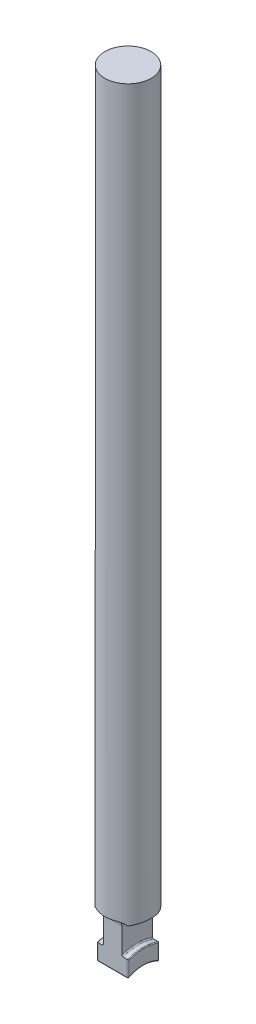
ISO-10303-21;
HEADER;
FILE_DESCRIPTION(('STEP AP214'),'2;1');
FILE_NAME('part.step','',(''),(''),'','','');
FILE_SCHEMA(('AUTOMOTIVE_DESIGN { 1 0 10303 214 1 1 1 1 }'));
ENDSEC;
DATA;
#1=APPLICATION_CONTEXT('core data for automotive mechanical design processes');
#2=APPLICATION_PROTOCOL_DEFINITION('international standard','automotive_design',2000,#1);
#3=PRODUCT_CONTEXT('',#1,'mechanical');
#4=PRODUCT('Part','Part','',(#3));
#5=PRODUCT_RELATED_PRODUCT_CATEGORY('part','',(#4));
#6=PRODUCT_DEFINITION_FORMATION('','',#4);
#7=PRODUCT_DEFINITION_CONTEXT('part definition',#1,'design');
#8=PRODUCT_DEFINITION('design','',#6,#7);
#9=PRODUCT_DEFINITION_SHAPE('','',#8);
#10=(LENGTH_UNIT() NAMED_UNIT(*) SI_UNIT(.MILLI.,.METRE.));
#11=(NAMED_UNIT(*) PLANE_ANGLE_UNIT() SI_UNIT($,.RADIAN.));
#12=(NAMED_UNIT(*) SI_UNIT($,.STERADIAN.) SOLID_ANGLE_UNIT());
#13=UNCERTAINTY_MEASURE_WITH_UNIT(LENGTH_MEASURE(1.E-05),#10,'distance_accuracy_value','');
#14=(GEOMETRIC_REPRESENTATION_CONTEXT(3) GLOBAL_UNCERTAINTY_ASSIGNED_CONTEXT((#13)) GLOBAL_UNIT_ASSIGNED_CONTEXT((#10,
#11,#12)) REPRESENTATION_CONTEXT('',''));
#15=CARTESIAN_POINT('',(0.,0.,0.));
#16=DIRECTION('',(0.,0.,1.));
#17=DIRECTION('',(1.,0.,0.));
#18=AXIS2_PLACEMENT_3D('',#15,#16,#17);
#19=CARTESIAN_POINT('',(-8.84822894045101,0.,0.));
#20=DIRECTION('',(-1.,0.,0.));
#21=DIRECTION('',(0.,0.,1.));
#22=AXIS2_PLACEMENT_3D('',#19,#20,#21);
#23=CYLINDRICAL_SURFACE('',#22,24.5);
#24=DIRECTION('',(1.,0.,0.));
#25=VECTOR('',#24,1.);
#26=CARTESIAN_POINT('',(-5.25000000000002,23.9023478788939,5.37845385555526));
#27=LINE('',#26,#25);
#28=CARTESIAN_POINT('',(-5.22706744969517,23.9023478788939,5.37845385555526));
#29=VERTEX_POINT('',#28);
#30=CARTESIAN_POINT('',(-3.762,23.9023478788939,5.37845385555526));
#31=VERTEX_POINT('',#30);
#32=EDGE_CURVE('E212',#29,#31,#27,.T.);
#33=ORIENTED_EDGE('',*,*,#32,.F.);
#34=CARTESIAN_POINT('',(-5.22706744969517,23.9023478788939,5.37845385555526));
#35=CARTESIAN_POINT('',(-5.37721681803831,23.9351862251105,5.23255073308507));
#36=CARTESIAN_POINT('',(-5.52123879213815,23.9680261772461,5.08033870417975));
#37=CARTESIAN_POINT('',(-5.79615269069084,24.0328420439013,4.76428673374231));
#38=CARTESIAN_POINT('',(-5.92704320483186,24.0648178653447,4.60044554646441));
#39=CARTESIAN_POINT('',(-6.1749112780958,24.127062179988,4.26198627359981));
#40=CARTESIAN_POINT('',(-6.29187466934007,24.1573289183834,4.0873574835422));
#41=CARTESIAN_POINT('',(-6.51089551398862,24.215296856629,3.72859259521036));
#42=CARTESIAN_POINT('',(-6.61295370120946,24.2429981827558,3.54445696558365));
#43=CARTESIAN_POINT('',(-6.80152520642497,24.2951130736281,3.16760350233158));
#44=CARTESIAN_POINT('',(-6.88801606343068,24.3195218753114,2.97487376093));
#45=CARTESIAN_POINT('',(-7.04456246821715,24.3643229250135,2.58239674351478));
#46=CARTESIAN_POINT('',(-7.11461823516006,24.3847152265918,2.38264956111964));
#47=CARTESIAN_POINT('',(-7.23763239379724,24.4208899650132,1.97772908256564));
#48=CARTESIAN_POINT('',(-7.29060493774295,24.4366762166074,1.77256043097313));
#49=CARTESIAN_POINT('',(-7.37904258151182,24.4632067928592,1.35816498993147));
#50=CARTESIAN_POINT('',(-7.41450829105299,24.4739512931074,1.14893834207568));
#51=CARTESIAN_POINT('',(-7.46683062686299,24.4898541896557,0.734088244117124));
#52=CARTESIAN_POINT('',(-7.48419330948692,24.4951644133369,0.528534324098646));
#53=CARTESIAN_POINT('',(-7.50192575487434,24.5005881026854,0.116628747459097));
#54=CARTESIAN_POINT('',(-7.50229592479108,24.5007016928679,-0.0897228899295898));
#55=CARTESIAN_POINT('',(-7.48603992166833,24.4957289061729,-0.501706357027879));
#56=CARTESIAN_POINT('',(-7.46941249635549,24.4906421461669,-0.707338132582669));
#57=CARTESIAN_POINT('',(-7.41931398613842,24.4754091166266,-1.11634597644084));
#58=CARTESIAN_POINT('',(-7.38584313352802,24.4652629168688,-1.31972207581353));
#59=CARTESIAN_POINT('',(-7.30322202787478,24.440448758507,-1.71859694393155));
#60=CARTESIAN_POINT('',(-7.25440851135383,24.4258781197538,-1.91417169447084));
#61=CARTESIAN_POINT('',(-7.14130504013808,24.3925258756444,-2.30049689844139));
#62=CARTESIAN_POINT('',(-7.07700972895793,24.373742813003,-2.49124565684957));
#63=CARTESIAN_POINT('',(-6.93347625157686,24.3324551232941,-2.86657877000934));
#64=CARTESIAN_POINT('',(-6.85424035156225,24.3099510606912,-3.05116405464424));
#65=CARTESIAN_POINT('',(-6.68138111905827,24.2617799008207,-3.41311869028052));
#66=CARTESIAN_POINT('',(-6.58775310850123,24.2361117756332,-3.59048567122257));
#67=CARTESIAN_POINT('',(-6.40110601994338,24.1860966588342,-3.91220371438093));
#68=CARTESIAN_POINT('',(-6.30989669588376,24.1620815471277,-4.0576610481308));
#69=CARTESIAN_POINT('',(-6.11784338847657,24.1126398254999,-4.34181967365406));
#70=CARTESIAN_POINT('',(-6.01699954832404,24.0872132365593,-4.48052106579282));
#71=CARTESIAN_POINT('',(-5.80630420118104,24.0354478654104,-4.75037751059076));
#72=CARTESIAN_POINT('',(-5.69646647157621,24.0091105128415,-4.88154360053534));
#73=CARTESIAN_POINT('',(-5.46813543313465,23.9559636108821,-5.13602418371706));
#74=CARTESIAN_POINT('',(-5.3496416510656,23.9291540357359,-5.25933824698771));
#75=CARTESIAN_POINT('',(-5.22706744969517,23.9023478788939,-5.37845385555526));
#76=B_SPLINE_CURVE_WITH_KNOTS('',3,(#34,#35,#36,#37,#38,#39,#40,#41,#42,#43,#44,#45,#46,#47,#48,
#49,#50,#51,#52,#53,#54,#55,#56,#57,#58,#59,#60,#61,#62,#63,#64,#65,#66,#67,#68,#69,#70,#71,#72,
#73,#74,#75),.UNSPECIFIED.,.F.,.F.,(4,2,2,2,2,2,2,2,2,2,2,2,2,2,2,2,2,2,2,2,4),(0.,
0.635589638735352,1.27124746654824,1.90754651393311,2.54381422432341,3.18099272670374,
3.81816273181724,4.45480352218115,5.09142213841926,5.70972414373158,6.3280113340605,
6.94634407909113,7.56466829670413,8.17027181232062,8.77608516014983,9.38180669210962,
9.9877255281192,10.5074103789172,11.0270875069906,11.5459829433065,12.0649067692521),.UNSPECIFIED.);
#77=CARTESIAN_POINT('',(-5.22706744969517,23.9023478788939,-5.37845385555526));
#78=VERTEX_POINT('',#77);
#79=EDGE_CURVE('E207',#29,#78,#76,.T.);
#80=ORIENTED_EDGE('',*,*,#79,.T.);
#81=DIRECTION('',(1.,0.,0.));
#82=VECTOR('',#81,1.);
#83=CARTESIAN_POINT('',(-5.25000000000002,23.9023478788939,-5.37845385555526));
#84=LINE('',#83,#82);
#85=CARTESIAN_POINT('',(-3.762,23.9023478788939,-5.37845385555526));
#86=VERTEX_POINT('',#85);
#87=EDGE_CURVE('E210',#86,#78,#84,.F.);
#88=ORIENTED_EDGE('',*,*,#87,.F.);
#89=CARTESIAN_POINT('',(-3.762,0.,0.));
#90=DIRECTION('',(-1.,0.,0.));
#91=DIRECTION('',(0.,0.,1.));
#92=AXIS2_PLACEMENT_3D('',#89,#90,#91);
#93=CIRCLE('',#92,24.5);
#94=EDGE_CURVE('E261',#86,#31,#93,.F.);
#95=ORIENTED_EDGE('',*,*,#94,.T.);
#96=EDGE_LOOP('',(#33,#80,#88,#95));
#97=FACE_BOUND('',#96,.T.);
#98=ADVANCED_FACE('F38',(#97),#23,.F.);
#99=CARTESIAN_POINT('',(-8.84822894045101,0.,0.));
#100=DIRECTION('',(-1.,0.,0.));
#101=DIRECTION('',(0.,0.,1.));
#102=AXIS2_PLACEMENT_3D('',#99,#100,#101);
#103=CYLINDRICAL_SURFACE('',#102,24.5);
#104=DIRECTION('',(1.,0.,0.));
#105=VECTOR('',#104,1.);
#106=CARTESIAN_POINT('',(5.25000000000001,23.9023478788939,-5.37845385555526));
#107=LINE('',#106,#105);
#108=CARTESIAN_POINT('',(5.22706744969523,23.9023478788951,-5.37845385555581));
#109=VERTEX_POINT('',#108);
#110=CARTESIAN_POINT('',(3.762,23.9023478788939,-5.37845385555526));
#111=VERTEX_POINT('',#110);
#112=EDGE_CURVE('E251',#109,#111,#107,.F.);
#113=ORIENTED_EDGE('',*,*,#112,.F.);
#114=CARTESIAN_POINT('',(5.22706744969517,23.9023478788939,-5.37845385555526));
#115=CARTESIAN_POINT('',(5.37721681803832,23.9351862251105,-5.23255073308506));
#116=CARTESIAN_POINT('',(5.52123879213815,23.9680261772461,-5.08033870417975));
#117=CARTESIAN_POINT('',(5.79615269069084,24.0328420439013,-4.76428673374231));
#118=CARTESIAN_POINT('',(5.92704320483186,24.0648178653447,-4.6004455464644));
#119=CARTESIAN_POINT('',(6.1749112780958,24.127062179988,-4.26198627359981));
#120=CARTESIAN_POINT('',(6.29187466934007,24.1573289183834,-4.0873574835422));
#121=CARTESIAN_POINT('',(6.51089551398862,24.215296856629,-3.72859259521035));
#122=CARTESIAN_POINT('',(6.61295370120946,24.2429981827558,-3.54445696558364));
#123=CARTESIAN_POINT('',(6.80152520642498,24.2951130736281,-3.16760350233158));
#124=CARTESIAN_POINT('',(6.88801606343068,24.3195218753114,-2.97487376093));
#125=CARTESIAN_POINT('',(7.04456246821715,24.3643229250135,-2.58239674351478));
#126=CARTESIAN_POINT('',(7.11461823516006,24.3847152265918,-2.38264956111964));
#127=CARTESIAN_POINT('',(7.23763239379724,24.4208899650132,-1.97772908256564));
#128=CARTESIAN_POINT('',(7.29060493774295,24.4366762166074,-1.77256043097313));
#129=CARTESIAN_POINT('',(7.37904258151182,24.4632067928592,-1.35816498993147));
#130=CARTESIAN_POINT('',(7.41450829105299,24.4739512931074,-1.14893834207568));
#131=CARTESIAN_POINT('',(7.46683062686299,24.4898541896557,-0.734088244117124));
#132=CARTESIAN_POINT('',(7.48419330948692,24.4951644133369,-0.528534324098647));
#133=CARTESIAN_POINT('',(7.50192575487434,24.5005881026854,-0.116628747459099));
#134=CARTESIAN_POINT('',(7.50229592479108,24.5007016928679,0.0897228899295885));
#135=CARTESIAN_POINT('',(7.48603992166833,24.4957289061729,0.501706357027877));
#136=CARTESIAN_POINT('',(7.46941249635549,24.4906421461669,0.707338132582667));
#137=CARTESIAN_POINT('',(7.41931398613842,24.4754091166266,1.11634597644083));
#138=CARTESIAN_POINT('',(7.38584313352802,24.4652629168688,1.31972207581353));
#139=CARTESIAN_POINT('',(7.30322202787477,24.440448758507,1.71859694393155));
#140=CARTESIAN_POINT('',(7.25440851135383,24.4258781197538,1.91417169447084));
#141=CARTESIAN_POINT('',(7.14130504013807,24.3925258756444,2.30049689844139));
#142=CARTESIAN_POINT('',(7.07700972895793,24.373742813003,2.49124565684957));
#143=CARTESIAN_POINT('',(6.93347625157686,24.3324551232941,2.86657877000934));
#144=CARTESIAN_POINT('',(6.85424035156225,24.3099510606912,3.05116405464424));
#145=CARTESIAN_POINT('',(6.68138111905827,24.2617799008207,3.41311869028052));
#146=CARTESIAN_POINT('',(6.58775310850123,24.2361117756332,3.59048567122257));
#147=CARTESIAN_POINT('',(6.40110601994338,24.1860966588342,3.91220371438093));
#148=CARTESIAN_POINT('',(6.30989669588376,24.1620815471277,4.0576610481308));
#149=CARTESIAN_POINT('',(6.11784338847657,24.1126398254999,4.34181967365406));
#150=CARTESIAN_POINT('',(6.01699954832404,24.0872132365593,4.48052106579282));
#151=CARTESIAN_POINT('',(5.80630420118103,24.0354478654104,4.75037751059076));
#152=CARTESIAN_POINT('',(5.69646647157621,24.0091105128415,4.88154360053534));
#153=CARTESIAN_POINT('',(5.46813543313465,23.9559636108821,5.13602418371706));
#154=CARTESIAN_POINT('',(5.3496416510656,23.9291540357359,5.25933824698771));
#155=CARTESIAN_POINT('',(5.22706744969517,23.9023478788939,5.37845385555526));
#156=B_SPLINE_CURVE_WITH_KNOTS('',3,(#114,#115,#116,#117,#118,#119,#120,#121,#122,#123,#124,
#125,#126,#127,#128,#129,#130,#131,#132,#133,#134,#135,#136,#137,#138,#139,#140,#141,#142,#143,
#144,#145,#146,#147,#148,#149,#150,#151,#152,#153,#154,#155),.UNSPECIFIED.,.F.,.F.,(4,2,2,2,2,2,
2,2,2,2,2,2,2,2,2,2,2,2,2,2,4),(0.,0.635589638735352,1.27124746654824,1.90754651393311,
2.5438142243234,3.18099272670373,3.81816273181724,4.45480352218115,5.09142213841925,
5.70972414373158,6.3280113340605,6.94634407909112,7.56466829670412,8.17027181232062,
8.77608516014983,9.38180669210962,9.9877255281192,10.5074103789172,11.0270875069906,
11.5459829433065,12.0649067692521),.UNSPECIFIED.);
#157=CARTESIAN_POINT('',(5.22706744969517,23.9023478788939,5.37845385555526));
#158=VERTEX_POINT('',#157);
#159=EDGE_CURVE('E362',#109,#158,#156,.T.);
#160=ORIENTED_EDGE('',*,*,#159,.T.);
#161=DIRECTION('',(1.,0.,0.));
#162=VECTOR('',#161,1.);
#163=CARTESIAN_POINT('',(5.25000000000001,23.9023478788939,5.37845385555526));
#164=LINE('',#163,#162);
#165=CARTESIAN_POINT('',(3.762,23.9023478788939,5.37845385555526));
#166=VERTEX_POINT('',#165);
#167=EDGE_CURVE('E248',#166,#158,#164,.T.);
#168=ORIENTED_EDGE('',*,*,#167,.F.);
#169=CARTESIAN_POINT('',(3.762,0.,0.));
#170=DIRECTION('',(1.,0.,0.));
#171=DIRECTION('',(0.,0.,-1.));
#172=AXIS2_PLACEMENT_3D('',#169,#170,#171);
#173=CIRCLE('',#172,24.5);
#174=EDGE_CURVE('E263',#166,#111,#173,.F.);
#175=ORIENTED_EDGE('',*,*,#174,.T.);
#176=EDGE_LOOP('',(#113,#160,#168,#175));
#177=FACE_BOUND('',#176,.T.);
#178=ADVANCED_FACE('F326',(#177),#103,.F.);
#179=CARTESIAN_POINT('',(-7.50000000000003,25.,7.3876));
#180=DIRECTION('',(0.,1.,0.));
#181=DIRECTION('',(0.,0.,1.));
#182=AXIS2_PLACEMENT_3D('',#179,#180,#181);
#183=PLANE('',#182);
#184=DIRECTION('',(1.,0.,0.));
#185=VECTOR('',#184,1.);
#186=CARTESIAN_POINT('',(-7.50000000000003,25.,7.3876));
#187=LINE('',#186,#185);
#188=CARTESIAN_POINT('',(-1.29358658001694,25.,7.3876));
#189=VERTEX_POINT('',#188);
#190=CARTESIAN_POINT('',(1.29358658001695,25.,7.3876));
#191=VERTEX_POINT('',#190);
#192=EDGE_CURVE('E384',#189,#191,#187,.T.);
#193=ORIENTED_EDGE('',*,*,#192,.T.);
#194=CARTESIAN_POINT('',(0.,25.,0.));
#195=DIRECTION('',(0.,1.,0.));
#196=DIRECTION('',(0.,0.,1.));
#197=AXIS2_PLACEMENT_3D('',#194,#195,#196);
#198=CIRCLE('',#197,7.5);
#199=EDGE_CURVE('E339',#189,#191,#198,.T.);
#200=ORIENTED_EDGE('',*,*,#199,.F.);
#201=EDGE_LOOP('',(#193,#200));
#202=FACE_BOUND('',#201,.T.);
#203=ADVANCED_FACE('F323',(#202),#183,.F.);
#204=CARTESIAN_POINT('',(-7.50000000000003,22.6124,7.3876));
#205=DIRECTION('',(1.,0.,0.));
#206=DIRECTION('',(0.,0.,-1.));
#207=AXIS2_PLACEMENT_3D('',#204,#205,#206);
#208=CYLINDRICAL_SURFACE('',#207,2.3876);
#209=CARTESIAN_POINT('',(1.29358658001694,25.,7.3876));
#210=CARTESIAN_POINT('',(1.39265936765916,24.9999899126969,7.37025335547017));
#211=CARTESIAN_POINT('',(1.4913838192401,24.9998106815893,7.35091116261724));
#212=CARTESIAN_POINT('',(1.6879834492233,24.9987797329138,7.30827107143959));
#213=CARTESIAN_POINT('',(1.78585852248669,24.9979279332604,7.28497269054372));
#214=CARTESIAN_POINT('',(1.98092542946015,24.9952127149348,7.23437091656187));
#215=CARTESIAN_POINT('',(2.07811364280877,24.9933457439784,7.20705370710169));
#216=CARTESIAN_POINT('',(2.27126404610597,24.9881822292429,7.14853453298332));
#217=CARTESIAN_POINT('',(2.36722628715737,24.9848857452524,7.11733273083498));
#218=CARTESIAN_POINT('',(2.6556791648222,24.9720505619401,7.01706293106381));
#219=CARTESIAN_POINT('',(2.84602192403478,24.9595783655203,6.94203362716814));
#220=CARTESIAN_POINT('',(3.21869582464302,24.9222175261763,6.77726661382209));
#221=CARTESIAN_POINT('',(3.40104165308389,24.8973527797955,6.68755743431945));
#222=CARTESIAN_POINT('',(3.65813049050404,24.8479812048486,6.54800797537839));
#223=CARTESIAN_POINT('',(3.73707712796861,24.8307462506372,6.50326180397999));
#224=CARTESIAN_POINT('',(3.8925178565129,24.7918994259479,6.4114306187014));
#225=CARTESIAN_POINT('',(3.96901187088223,24.7702874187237,6.36434553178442));
#226=CARTESIAN_POINT('',(4.11888325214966,24.7221081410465,6.26838784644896));
#227=CARTESIAN_POINT('',(4.19227064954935,24.6955585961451,6.21952212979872));
#228=CARTESIAN_POINT('',(4.33572363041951,24.6367813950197,6.1203852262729));
#229=CARTESIAN_POINT('',(4.40578976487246,24.6045546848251,6.07011427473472));
#230=CARTESIAN_POINT('',(4.58820100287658,24.5097544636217,5.9345244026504));
#231=CARTESIAN_POINT('',(4.69711952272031,24.4413904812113,5.84847853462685));
#232=CARTESIAN_POINT('',(4.90096831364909,24.2838574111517,5.67873751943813));
#233=CARTESIAN_POINT('',(4.99591447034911,24.1947122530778,5.59503979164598));
#234=CARTESIAN_POINT('',(5.1483352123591,24.01734813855,5.454615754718));
#235=CARTESIAN_POINT('',(5.20940385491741,23.9336432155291,5.39611687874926));
#236=CARTESIAN_POINT('',(5.31939660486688,23.7535294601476,5.28771955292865));
#237=CARTESIAN_POINT('',(5.36832258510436,23.6571225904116,5.23781977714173));
#238=CARTESIAN_POINT('',(5.45276794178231,23.4524181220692,5.14986527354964));
#239=CARTESIAN_POINT('',(5.4881822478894,23.344035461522,5.11190376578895));
#240=CARTESIAN_POINT('',(5.52985007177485,23.1757188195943,5.06667214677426));
#241=CARTESIAN_POINT('',(5.5418289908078,23.1186697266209,5.05354836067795));
#242=CARTESIAN_POINT('',(5.56189721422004,23.0031126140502,5.03145359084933));
#243=CARTESIAN_POINT('',(5.56998890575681,22.9446055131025,5.02248005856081));
#244=CARTESIAN_POINT('',(5.58078481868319,22.8404330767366,5.0104780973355));
#245=CARTESIAN_POINT('',(5.58430495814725,22.7949512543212,5.00655170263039));
#246=CARTESIAN_POINT('',(5.58899645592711,22.7037821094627,5.00131198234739));
#247=CARTESIAN_POINT('',(5.59017114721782,22.6580951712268,4.99999494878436));
#248=CARTESIAN_POINT('',(5.59016994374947,22.6124,5.));
#249=B_SPLINE_CURVE_WITH_KNOTS('',3,(#209,#210,#211,#212,#213,#214,#215,#216,#217,#218,#219,
#220,#221,#222,#223,#224,#225,#226,#227,#228,#229,#230,#231,#232,#233,#234,#235,#236,#237,#238,
#239,#240,#241,#242,#243,#244,#245,#246,#247,#248),.UNSPECIFIED.,.F.,.F.,(4,2,2,2,2,2,2,2,2,2,2,
2,2,2,2,2,2,2,2,4),(0.,0.301720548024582,0.603477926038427,0.906298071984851,1.20910555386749,
1.82310205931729,2.43591915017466,2.71288899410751,2.98986749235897,3.26587019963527,
3.54182695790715,4.00427062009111,4.46618438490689,4.8217280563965,5.17721685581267,
5.53541626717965,5.71443494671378,5.89334354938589,6.03057448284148,6.16761026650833),.UNSPECIFIED.);
#250=EDGE_CURVE('E367',#191,#158,#249,.T.);
#251=ORIENTED_EDGE('',*,*,#250,.F.);
#252=ORIENTED_EDGE('',*,*,#192,.F.);
#253=CARTESIAN_POINT('',(-5.59016994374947,22.6124,5.));
#254=CARTESIAN_POINT('',(-5.59017364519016,22.6656027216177,4.99998879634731));
#255=CARTESIAN_POINT('',(-5.58857952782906,22.7188001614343,5.00177796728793));
#256=CARTESIAN_POINT('',(-5.58222515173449,22.8247518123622,5.00887250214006));
#257=CARTESIAN_POINT('',(-5.57746599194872,22.8775061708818,5.01417664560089));
#258=CARTESIAN_POINT('',(-5.56484217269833,22.9819185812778,5.02818208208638));
#259=CARTESIAN_POINT('',(-5.55699293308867,23.0335807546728,5.03686650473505));
#260=CARTESIAN_POINT('',(-5.53825211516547,23.1356816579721,5.05746543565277));
#261=CARTESIAN_POINT('',(-5.52736041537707,23.1861203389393,5.06938007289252));
#262=CARTESIAN_POINT('',(-5.49024427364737,23.3349781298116,5.10965385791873));
#263=CARTESIAN_POINT('',(-5.45955609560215,23.431125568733,5.14256886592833));
#264=CARTESIAN_POINT('',(-5.38713823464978,23.6149117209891,5.21837810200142));
#265=CARTESIAN_POINT('',(-5.34539949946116,23.7025433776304,5.26128050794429));
#266=CARTESIAN_POINT('',(-5.25000549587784,23.871398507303,5.3565064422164));
#267=CARTESIAN_POINT('',(-5.19592284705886,23.9521974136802,5.40915033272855));
#268=CARTESIAN_POINT('',(-5.07831608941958,24.1024816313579,5.51971119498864));
#269=CARTESIAN_POINT('',(-5.01478809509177,24.1719622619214,5.57763033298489));
#270=CARTESIAN_POINT('',(-4.89537460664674,24.2849852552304,5.68243638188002));
#271=CARTESIAN_POINT('',(-4.84112675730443,24.330808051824,5.7287715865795));
#272=CARTESIAN_POINT('',(-4.72846476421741,24.4162526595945,5.82211228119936));
#273=CARTESIAN_POINT('',(-4.67004883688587,24.4558717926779,5.869118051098));
#274=CARTESIAN_POINT('',(-4.48918584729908,24.5661643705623,6.01002907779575));
#275=CARTESIAN_POINT('',(-4.36122917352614,24.628176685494,6.10373385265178));
#276=CARTESIAN_POINT('',(-4.12618139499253,24.7207132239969,6.26417804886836));
#277=CARTESIAN_POINT('',(-4.02132632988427,24.7552166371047,6.3320475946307));
#278=CARTESIAN_POINT('',(-3.80639006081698,24.815114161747,6.46353195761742));
#279=CARTESIAN_POINT('',(-3.69630588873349,24.8405030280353,6.52714430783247));
#280=CARTESIAN_POINT('',(-3.47154987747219,24.8839523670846,6.64941988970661));
#281=CARTESIAN_POINT('',(-3.35686324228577,24.9019867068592,6.70806489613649));
#282=CARTESIAN_POINT('',(-3.12398018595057,24.9321818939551,6.81963514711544));
#283=CARTESIAN_POINT('',(-3.0057830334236,24.9443415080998,6.87255918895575));
#284=CARTESIAN_POINT('',(-2.75787961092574,24.9648721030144,6.97591654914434));
#285=CARTESIAN_POINT('',(-2.62795732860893,24.9729073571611,7.02589634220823));
#286=CARTESIAN_POINT('',(-2.36536195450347,24.9852579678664,7.11859949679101));
#287=CARTESIAN_POINT('',(-2.23268835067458,24.9895726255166,7.16132149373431));
#288=CARTESIAN_POINT('',(-1.96653288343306,24.9956822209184,7.23890570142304));
#289=CARTESIAN_POINT('',(-1.83307432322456,24.9975032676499,7.27384609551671));
#290=CARTESIAN_POINT('',(-1.56448823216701,24.9996435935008,7.33630683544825));
#291=CARTESIAN_POINT('',(-1.4293615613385,24.9999636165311,7.36383085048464));
#292=CARTESIAN_POINT('',(-1.29358658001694,25.,7.3876));
#293=B_SPLINE_CURVE_WITH_KNOTS('',3,(#253,#254,#255,#256,#257,#258,#259,#260,#261,#262,#263,
#264,#265,#266,#267,#268,#269,#270,#271,#272,#273,#274,#275,#276,#277,#278,#279,#280,#281,#282,
#283,#284,#285,#286,#287,#288,#289,#290,#291,#292),.UNSPECIFIED.,.F.,.F.,(4,2,2,2,2,2,2,2,2,2,2,
2,2,2,2,2,2,2,2,4),(0.,0.159545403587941,0.319035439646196,0.47773948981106,0.636449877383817,
0.953308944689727,1.27042838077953,1.60088618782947,1.93148031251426,2.18550735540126,
2.43964376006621,2.94842369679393,3.33669979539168,3.72519898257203,4.11506684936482,
4.5050165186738,4.92303619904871,5.34113438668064,5.75482057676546,6.16830172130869),.UNSPECIFIED.);
#294=EDGE_CURVE('E214',#29,#189,#293,.T.);
#295=ORIENTED_EDGE('',*,*,#294,.F.);
#296=ORIENTED_EDGE('',*,*,#32,.T.);
#297=CARTESIAN_POINT('',(-3.762,23.9023478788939,5.37845385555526));
#298=CARTESIAN_POINT('',(-3.72052247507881,23.9023782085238,5.37850996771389));
#299=CARTESIAN_POINT('',(-3.67908434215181,23.8993176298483,5.3765083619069));
#300=CARTESIAN_POINT('',(-3.59755784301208,23.8872677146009,5.36882927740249));
#301=CARTESIAN_POINT('',(-3.55746561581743,23.878297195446,5.3631634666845));
#302=CARTESIAN_POINT('',(-3.47964593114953,23.8546840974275,5.34859443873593));
#303=CARTESIAN_POINT('',(-3.44191719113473,23.8400446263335,5.33969299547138));
#304=CARTESIAN_POINT('',(-3.36969597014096,23.8054628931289,5.31935465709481));
#305=CARTESIAN_POINT('',(-3.33520561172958,23.78551718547,5.3079161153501));
#306=CARTESIAN_POINT('',(-3.26907160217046,23.7399278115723,5.28284027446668));
#307=CARTESIAN_POINT('',(-3.23757738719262,23.7141030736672,5.26913806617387));
#308=CARTESIAN_POINT('',(-3.17965599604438,23.6577245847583,5.24075921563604));
#309=CARTESIAN_POINT('',(-3.15323009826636,23.6271696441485,5.22608232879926));
#310=CARTESIAN_POINT('',(-3.10536671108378,23.5608856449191,5.19616867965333));
#311=CARTESIAN_POINT('',(-3.08411727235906,23.5250216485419,5.18092910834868));
#312=CARTESIAN_POINT('',(-3.04843510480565,23.4497519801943,5.15128458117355));
#313=CARTESIAN_POINT('',(-3.03399604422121,23.4103496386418,5.13687886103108));
#314=CARTESIAN_POINT('',(-3.01554638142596,23.3407273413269,5.11359305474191));
#315=CARTESIAN_POINT('',(-3.00973379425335,23.3111072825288,5.1043115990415));
#316=CARTESIAN_POINT('',(-3.00195563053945,23.251066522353,5.08678910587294));
#317=CARTESIAN_POINT('',(-2.99999006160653,23.2206458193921,5.0785480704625));
#318=CARTESIAN_POINT('',(-3.,23.190047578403,5.07093061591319));
#319=B_SPLINE_CURVE_WITH_KNOTS('',3,(#297,#298,#299,#300,#301,#302,#303,#304,#305,#306,#307,
#308,#309,#310,#311,#312,#313,#314,#315,#316,#317,#318),.UNSPECIFIED.,.F.,.F.,(4,2,2,2,2,2,2,2,
2,2,4),(0.,0.124210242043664,0.248026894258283,0.371775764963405,0.495605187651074,
0.623944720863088,0.75231658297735,0.884822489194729,1.01720495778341,1.11169528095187,
1.20618579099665),.UNSPECIFIED.);
#320=CARTESIAN_POINT('',(-3.,23.190047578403,5.07093061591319));
#321=VERTEX_POINT('',#320);
#322=EDGE_CURVE('E274',#31,#321,#319,.T.);
#323=ORIENTED_EDGE('',*,*,#322,.T.);
#324=CARTESIAN_POINT('',(-3.,22.6124,7.3876));
#325=DIRECTION('',(-1.,0.,0.));
#326=DIRECTION('',(0.,0.,1.));
#327=AXIS2_PLACEMENT_3D('',#324,#325,#326);
#328=CIRCLE('',#327,2.3876);
#329=CARTESIAN_POINT('',(-3.,22.6124,5.));
#330=VERTEX_POINT('',#329);
#331=EDGE_CURVE('E230',#321,#330,#328,.T.);
#332=ORIENTED_EDGE('',*,*,#331,.T.);
#333=DIRECTION('',(1.,0.,0.));
#334=VECTOR('',#333,1.);
#335=CARTESIAN_POINT('',(-7.50000000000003,22.6124,5.));
#336=LINE('',#335,#334);
#337=CARTESIAN_POINT('',(3.,22.6124,5.));
#338=VERTEX_POINT('',#337);
#339=EDGE_CURVE('E381',#330,#338,#336,.T.);
#340=ORIENTED_EDGE('',*,*,#339,.T.);
#341=CARTESIAN_POINT('',(3.,22.6124,7.3876));
#342=DIRECTION('',(1.,0.,0.));
#343=DIRECTION('',(0.,0.,-1.));
#344=AXIS2_PLACEMENT_3D('',#341,#342,#343);
#345=CIRCLE('',#344,2.3876);
#346=CARTESIAN_POINT('',(3.,23.190047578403,5.07093061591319));
#347=VERTEX_POINT('',#346);
#348=EDGE_CURVE('E378',#338,#347,#345,.T.);
#349=ORIENTED_EDGE('',*,*,#348,.T.);
#350=CARTESIAN_POINT('',(3.,23.190047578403,5.07093061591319));
#351=CARTESIAN_POINT('',(2.99996040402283,23.2308129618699,5.08105410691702));
#352=CARTESIAN_POINT('',(3.00346720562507,23.2712550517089,5.09232014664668));
#353=CARTESIAN_POINT('',(3.01721655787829,23.3503342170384,5.11653393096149));
#354=CARTESIAN_POINT('',(3.02744017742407,23.3889760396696,5.12947686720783));
#355=CARTESIAN_POINT('',(3.05426360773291,23.4635197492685,5.15649809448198));
#356=CARTESIAN_POINT('',(3.07086050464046,23.499422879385,5.1705758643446));
#357=CARTESIAN_POINT('',(3.10990626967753,23.5677282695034,5.19914149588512));
#358=CARTESIAN_POINT('',(3.13235836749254,23.6001285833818,5.21362957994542));
#359=CARTESIAN_POINT('',(3.18331869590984,23.6617315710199,5.24266752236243));
#360=CARTESIAN_POINT('',(3.2119969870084,23.6907995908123,5.25720466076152));
#361=CARTESIAN_POINT('',(3.27424280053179,23.7439263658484,5.28493943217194));
#362=CARTESIAN_POINT('',(3.30781162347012,23.7679837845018,5.29813670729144));
#363=CARTESIAN_POINT('',(3.37985283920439,23.8110601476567,5.32253913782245));
#364=CARTESIAN_POINT('',(3.41842011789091,23.8299507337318,5.33369160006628));
#365=CARTESIAN_POINT('',(3.49878377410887,23.861434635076,5.35268318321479));
#366=CARTESIAN_POINT('',(3.54057643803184,23.8740350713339,5.36052604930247));
#367=CARTESIAN_POINT('',(3.61250081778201,23.8896154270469,5.37032180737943));
#368=CARTESIAN_POINT('',(3.64211287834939,23.8943806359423,5.37335470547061));
#369=CARTESIAN_POINT('',(3.70180980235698,23.9007498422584,5.37742778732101));
#370=CARTESIAN_POINT('',(3.73189467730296,23.9023537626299,5.37846792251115));
#371=CARTESIAN_POINT('',(3.762,23.9023478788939,5.37845385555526));
#372=B_SPLINE_CURVE_WITH_KNOTS('',3,(#350,#351,#352,#353,#354,#355,#356,#357,#358,#359,#360,
#361,#362,#363,#364,#365,#366,#367,#368,#369,#370,#371),.UNSPECIFIED.,.F.,.F.,(4,2,2,2,2,2,2,2,
2,2,4),(0.,0.125791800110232,0.251230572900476,0.376612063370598,0.502062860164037,
0.631507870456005,0.760987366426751,0.893439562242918,1.02574146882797,1.11595722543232,
1.20617518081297),.UNSPECIFIED.);
#373=EDGE_CURVE('E309',#347,#166,#372,.T.);
#374=ORIENTED_EDGE('',*,*,#373,.T.);
#375=ORIENTED_EDGE('',*,*,#167,.T.);
#376=EDGE_LOOP('',(#251,#252,#295,#296,#323,#332,#340,#349,#374,#375));
#377=FACE_BOUND('',#376,.T.);
#378=ADVANCED_FACE('F317',(#377),#208,.F.);
#379=CARTESIAN_POINT('',(-7.50000000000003,25.,-7.3876));
#380=DIRECTION('',(0.,1.,0.));
#381=DIRECTION('',(0.,0.,1.));
#382=AXIS2_PLACEMENT_3D('',#379,#380,#381);
#383=PLANE('',#382);
#384=CARTESIAN_POINT('',(0.,25.,0.));
#385=DIRECTION('',(0.,1.,0.));
#386=DIRECTION('',(0.,0.,1.));
#387=AXIS2_PLACEMENT_3D('',#384,#385,#386);
#388=CIRCLE('',#387,7.5);
#389=CARTESIAN_POINT('',(1.29358658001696,25.,-7.3876));
#390=VERTEX_POINT('',#389);
#391=CARTESIAN_POINT('',(-1.29358658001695,25.,-7.3876));
#392=VERTEX_POINT('',#391);
#393=EDGE_CURVE('E59',#390,#392,#388,.T.);
#394=ORIENTED_EDGE('',*,*,#393,.F.);
#395=DIRECTION('',(1.,0.,0.));
#396=VECTOR('',#395,1.);
#397=CARTESIAN_POINT('',(-7.50000000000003,25.,-7.3876));
#398=LINE('',#397,#396);
#399=EDGE_CURVE('E379',#392,#390,#398,.T.);
#400=ORIENTED_EDGE('',*,*,#399,.F.);
#401=EDGE_LOOP('',(#394,#400));
#402=FACE_BOUND('',#401,.T.);
#403=ADVANCED_FACE('F322',(#402),#383,.F.);
#404=CARTESIAN_POINT('',(-7.50000000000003,22.6124,-7.3876));
#405=DIRECTION('',(1.,0.,0.));
#406=DIRECTION('',(0.,0.,-1.));
#407=AXIS2_PLACEMENT_3D('',#404,#405,#406);
#408=CYLINDRICAL_SURFACE('',#407,2.3876);
#409=CARTESIAN_POINT('',(5.59016994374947,22.6124,-5.));
#410=CARTESIAN_POINT('',(5.59017364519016,22.6656027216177,-4.99998879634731));
#411=CARTESIAN_POINT('',(5.58857952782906,22.7188001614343,-5.00177796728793));
#412=CARTESIAN_POINT('',(5.58222515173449,22.8247518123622,-5.00887250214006));
#413=CARTESIAN_POINT('',(5.57746599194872,22.8775061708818,-5.01417664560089));
#414=CARTESIAN_POINT('',(5.56484217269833,22.9819185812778,-5.02818208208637));
#415=CARTESIAN_POINT('',(5.55699293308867,23.0335807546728,-5.03686650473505));
#416=CARTESIAN_POINT('',(5.53825211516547,23.1356816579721,-5.05746543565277));
#417=CARTESIAN_POINT('',(5.52736041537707,23.1861203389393,-5.06938007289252));
#418=CARTESIAN_POINT('',(5.49024427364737,23.3349781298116,-5.10965385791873));
#419=CARTESIAN_POINT('',(5.45955609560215,23.431125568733,-5.14256886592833));
#420=CARTESIAN_POINT('',(5.38713823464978,23.6149117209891,-5.21837810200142));
#421=CARTESIAN_POINT('',(5.34539949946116,23.7025433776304,-5.26128050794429));
#422=CARTESIAN_POINT('',(5.25000549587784,23.871398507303,-5.3565064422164));
#423=CARTESIAN_POINT('',(5.19592284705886,23.9521974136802,-5.40915033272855));
#424=CARTESIAN_POINT('',(5.07831608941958,24.1024816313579,-5.51971119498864));
#425=CARTESIAN_POINT('',(5.01478809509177,24.1719622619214,-5.57763033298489));
#426=CARTESIAN_POINT('',(4.89537460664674,24.2849852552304,-5.68243638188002));
#427=CARTESIAN_POINT('',(4.84112675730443,24.330808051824,-5.7287715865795));
#428=CARTESIAN_POINT('',(4.72846476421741,24.4162526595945,-5.82211228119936));
#429=CARTESIAN_POINT('',(4.67004883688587,24.4558717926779,-5.869118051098));
#430=CARTESIAN_POINT('',(4.48918584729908,24.5661643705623,-6.01002907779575));
#431=CARTESIAN_POINT('',(4.36122917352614,24.628176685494,-6.10373385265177));
#432=CARTESIAN_POINT('',(4.12618139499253,24.7207132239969,-6.26417804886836));
#433=CARTESIAN_POINT('',(4.02132632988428,24.7552166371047,-6.3320475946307));
#434=CARTESIAN_POINT('',(3.80639006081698,24.815114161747,-6.46353195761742));
#435=CARTESIAN_POINT('',(3.69630588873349,24.8405030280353,-6.52714430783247));
#436=CARTESIAN_POINT('',(3.47154987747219,24.8839523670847,-6.6494198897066));
#437=CARTESIAN_POINT('',(3.35686324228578,24.9019867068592,-6.70806489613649));
#438=CARTESIAN_POINT('',(3.12398018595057,24.9321818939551,-6.81963514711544));
#439=CARTESIAN_POINT('',(3.0057830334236,24.9443415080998,-6.87255918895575));
#440=CARTESIAN_POINT('',(2.75787961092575,24.9648721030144,-6.97591654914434));
#441=CARTESIAN_POINT('',(2.62795732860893,24.9729073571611,-7.02589634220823));
#442=CARTESIAN_POINT('',(2.36536195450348,24.9852579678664,-7.11859949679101));
#443=CARTESIAN_POINT('',(2.23268835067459,24.9895726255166,-7.16132149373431));
#444=CARTESIAN_POINT('',(1.96653288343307,24.9956822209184,-7.23890570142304));
#445=CARTESIAN_POINT('',(1.83307432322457,24.9975032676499,-7.27384609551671));
#446=CARTESIAN_POINT('',(1.56448823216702,24.9996435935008,-7.33630683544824));
#447=CARTESIAN_POINT('',(1.42936156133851,24.9999636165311,-7.36383085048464));
#448=CARTESIAN_POINT('',(1.29358658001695,25.,-7.3876));
#449=B_SPLINE_CURVE_WITH_KNOTS('',3,(#409,#410,#411,#412,#413,#414,#415,#416,#417,#418,#419,
#420,#421,#422,#423,#424,#425,#426,#427,#428,#429,#430,#431,#432,#433,#434,#435,#436,#437,#438,
#439,#440,#441,#442,#443,#444,#445,#446,#447,#448),.UNSPECIFIED.,.F.,.F.,(4,2,2,2,2,2,2,2,2,2,2,
2,2,2,2,2,2,2,2,4),(0.,0.159545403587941,0.319035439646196,0.47773948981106,0.636449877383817,
0.953308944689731,1.27042838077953,1.60088618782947,1.93148031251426,2.18550735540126,
2.43964376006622,2.94842369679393,3.33669979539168,3.72519898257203,4.11506684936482,
4.5050165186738,4.92303619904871,5.34113438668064,5.75482057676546,6.16830172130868),.UNSPECIFIED.);
#450=EDGE_CURVE('E12',#109,#390,#449,.T.);
#451=ORIENTED_EDGE('',*,*,#450,.F.);
#452=ORIENTED_EDGE('',*,*,#112,.T.);
#453=CARTESIAN_POINT('',(3.762,23.9023478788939,-5.37845385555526));
#454=CARTESIAN_POINT('',(3.72052247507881,23.9023782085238,-5.37850996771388));
#455=CARTESIAN_POINT('',(3.67908434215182,23.8993176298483,-5.3765083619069));
#456=CARTESIAN_POINT('',(3.59755784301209,23.8872677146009,-5.36882927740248));
#457=CARTESIAN_POINT('',(3.55746561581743,23.878297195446,-5.3631634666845));
#458=CARTESIAN_POINT('',(3.47964593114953,23.8546840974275,-5.34859443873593));
#459=CARTESIAN_POINT('',(3.44191719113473,23.8400446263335,-5.33969299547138));
#460=CARTESIAN_POINT('',(3.36969597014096,23.8054628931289,-5.31935465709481));
#461=CARTESIAN_POINT('',(3.33520561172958,23.78551718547,-5.3079161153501));
#462=CARTESIAN_POINT('',(3.26907160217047,23.7399278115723,-5.28284027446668));
#463=CARTESIAN_POINT('',(3.23757738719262,23.7141030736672,-5.26913806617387));
#464=CARTESIAN_POINT('',(3.17965599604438,23.6577245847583,-5.24075921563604));
#465=CARTESIAN_POINT('',(3.15323009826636,23.6271696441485,-5.22608232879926));
#466=CARTESIAN_POINT('',(3.10536671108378,23.5608856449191,-5.19616867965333));
#467=CARTESIAN_POINT('',(3.08411727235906,23.5250216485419,-5.18092910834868));
#468=CARTESIAN_POINT('',(3.04843510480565,23.4497519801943,-5.15128458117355));
#469=CARTESIAN_POINT('',(3.03399604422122,23.4103496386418,-5.13687886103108));
#470=CARTESIAN_POINT('',(3.01554638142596,23.3407273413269,-5.11359305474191));
#471=CARTESIAN_POINT('',(3.00973379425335,23.3111072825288,-5.1043115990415));
#472=CARTESIAN_POINT('',(3.00195563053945,23.251066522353,-5.08678910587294));
#473=CARTESIAN_POINT('',(2.99999006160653,23.2206458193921,-5.0785480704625));
#474=CARTESIAN_POINT('',(3.,23.190047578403,-5.07093061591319));
#475=B_SPLINE_CURVE_WITH_KNOTS('',3,(#453,#454,#455,#456,#457,#458,#459,#460,#461,#462,#463,
#464,#465,#466,#467,#468,#469,#470,#471,#472,#473,#474),.UNSPECIFIED.,.F.,.F.,(4,2,2,2,2,2,2,2,
2,2,4),(0.,0.124210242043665,0.248026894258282,0.371775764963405,0.495605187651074,
0.623944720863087,0.752316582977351,0.88482248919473,1.01720495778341,1.11169528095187,
1.20618579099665),.UNSPECIFIED.);
#476=CARTESIAN_POINT('',(3.,23.190047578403,-5.07093061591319));
#477=VERTEX_POINT('',#476);
#478=EDGE_CURVE('E303',#111,#477,#475,.T.);
#479=ORIENTED_EDGE('',*,*,#478,.T.);
#480=CARTESIAN_POINT('',(3.,22.6124,-7.3876));
#481=DIRECTION('',(1.,0.,0.));
#482=DIRECTION('',(0.,0.,-1.));
#483=AXIS2_PLACEMENT_3D('',#480,#481,#482);
#484=CIRCLE('',#483,2.3876);
#485=CARTESIAN_POINT('',(3.,22.6124,-5.));
#486=VERTEX_POINT('',#485);
#487=EDGE_CURVE('E226',#477,#486,#484,.T.);
#488=ORIENTED_EDGE('',*,*,#487,.T.);
#489=DIRECTION('',(1.,0.,0.));
#490=VECTOR('',#489,1.);
#491=CARTESIAN_POINT('',(-7.50000000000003,22.6124,-5.));
#492=LINE('',#491,#490);
#493=CARTESIAN_POINT('',(-3.,22.6124,-5.));
#494=VERTEX_POINT('',#493);
#495=EDGE_CURVE('E375',#494,#486,#492,.T.);
#496=ORIENTED_EDGE('',*,*,#495,.F.);
#497=CARTESIAN_POINT('',(-3.,22.6124,-7.3876));
#498=DIRECTION('',(-1.,0.,0.));
#499=DIRECTION('',(0.,0.,1.));
#500=AXIS2_PLACEMENT_3D('',#497,#498,#499);
#501=CIRCLE('',#500,2.3876);
#502=CARTESIAN_POINT('',(-3.,23.190047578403,-5.07093061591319));
#503=VERTEX_POINT('',#502);
#504=EDGE_CURVE('E225',#494,#503,#501,.T.);
#505=ORIENTED_EDGE('',*,*,#504,.T.);
#506=CARTESIAN_POINT('',(-3.,23.190047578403,-5.07093061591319));
#507=CARTESIAN_POINT('',(-2.99996040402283,23.2308129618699,-5.08105410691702));
#508=CARTESIAN_POINT('',(-3.00346720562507,23.2712550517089,-5.09232014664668));
#509=CARTESIAN_POINT('',(-3.01721655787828,23.3503342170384,-5.11653393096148));
#510=CARTESIAN_POINT('',(-3.02744017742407,23.3889760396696,-5.12947686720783));
#511=CARTESIAN_POINT('',(-3.05426360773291,23.4635197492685,-5.15649809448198));
#512=CARTESIAN_POINT('',(-3.07086050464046,23.499422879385,-5.1705758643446));
#513=CARTESIAN_POINT('',(-3.10990626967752,23.5677282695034,-5.19914149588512));
#514=CARTESIAN_POINT('',(-3.13235836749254,23.6001285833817,-5.21362957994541));
#515=CARTESIAN_POINT('',(-3.18331869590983,23.6617315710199,-5.24266752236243));
#516=CARTESIAN_POINT('',(-3.21199698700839,23.6907995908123,-5.25720466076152));
#517=CARTESIAN_POINT('',(-3.27424280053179,23.7439263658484,-5.28493943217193));
#518=CARTESIAN_POINT('',(-3.30781162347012,23.7679837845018,-5.29813670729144));
#519=CARTESIAN_POINT('',(-3.37985283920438,23.8110601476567,-5.32253913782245));
#520=CARTESIAN_POINT('',(-3.4184201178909,23.8299507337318,-5.33369160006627));
#521=CARTESIAN_POINT('',(-3.49878377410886,23.861434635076,-5.35268318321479));
#522=CARTESIAN_POINT('',(-3.54057643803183,23.8740350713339,-5.36052604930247));
#523=CARTESIAN_POINT('',(-3.61250081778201,23.8896154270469,-5.37032180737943));
#524=CARTESIAN_POINT('',(-3.64211287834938,23.8943806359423,-5.37335470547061));
#525=CARTESIAN_POINT('',(-3.70180980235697,23.9007498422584,-5.377427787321));
#526=CARTESIAN_POINT('',(-3.73189467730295,23.9023537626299,-5.37846792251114));
#527=CARTESIAN_POINT('',(-3.762,23.9023478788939,-5.37845385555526));
#528=B_SPLINE_CURVE_WITH_KNOTS('',3,(#506,#507,#508,#509,#510,#511,#512,#513,#514,#515,#516,
#517,#518,#519,#520,#521,#522,#523,#524,#525,#526,#527),.UNSPECIFIED.,.F.,.F.,(4,2,2,2,2,2,2,2,
2,2,4),(0.,0.125791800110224,0.251230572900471,0.376612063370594,0.502062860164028,
0.631507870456,0.760987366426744,0.89343956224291,1.02574146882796,1.11595722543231,
1.20617518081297),.UNSPECIFIED.);
#529=EDGE_CURVE('E224',#503,#86,#528,.T.);
#530=ORIENTED_EDGE('',*,*,#529,.T.);
#531=ORIENTED_EDGE('',*,*,#87,.T.);
#532=CARTESIAN_POINT('',(-1.29358658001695,25.,-7.3876));
#533=CARTESIAN_POINT('',(-1.39265936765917,24.9999899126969,-7.37025335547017));
#534=CARTESIAN_POINT('',(-1.49138381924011,24.9998106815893,-7.35091116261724));
#535=CARTESIAN_POINT('',(-1.68798344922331,24.9987797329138,-7.30827107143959));
#536=CARTESIAN_POINT('',(-1.7858585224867,24.9979279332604,-7.28497269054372));
#537=CARTESIAN_POINT('',(-1.98092542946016,24.9952127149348,-7.23437091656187));
#538=CARTESIAN_POINT('',(-2.07811364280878,24.9933457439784,-7.20705370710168));
#539=CARTESIAN_POINT('',(-2.27126404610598,24.9881822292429,-7.14853453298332));
#540=CARTESIAN_POINT('',(-2.36722628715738,24.9848857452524,-7.11733273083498));
#541=CARTESIAN_POINT('',(-2.65567916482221,24.9720505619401,-7.01706293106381));
#542=CARTESIAN_POINT('',(-2.84602192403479,24.9595783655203,-6.94203362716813));
#543=CARTESIAN_POINT('',(-3.21869582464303,24.9222175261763,-6.77726661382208));
#544=CARTESIAN_POINT('',(-3.4010416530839,24.8973527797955,-6.68755743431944));
#545=CARTESIAN_POINT('',(-3.65813049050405,24.8479812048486,-6.54800797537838));
#546=CARTESIAN_POINT('',(-3.73707712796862,24.8307462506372,-6.50326180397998));
#547=CARTESIAN_POINT('',(-3.89251785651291,24.7918994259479,-6.41143061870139));
#548=CARTESIAN_POINT('',(-3.96901187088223,24.7702874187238,-6.36434553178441));
#549=CARTESIAN_POINT('',(-4.11888325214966,24.7221081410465,-6.26838784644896));
#550=CARTESIAN_POINT('',(-4.19227064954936,24.6955585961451,-6.21952212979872));
#551=CARTESIAN_POINT('',(-4.33572363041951,24.6367813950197,-6.12038522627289));
#552=CARTESIAN_POINT('',(-4.40578976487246,24.6045546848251,-6.07011427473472));
#553=CARTESIAN_POINT('',(-4.58820100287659,24.5097544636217,-5.93452440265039));
#554=CARTESIAN_POINT('',(-4.69711952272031,24.4413904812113,-5.84847853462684));
#555=CARTESIAN_POINT('',(-4.9009683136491,24.2838574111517,-5.67873751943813));
#556=CARTESIAN_POINT('',(-4.99591447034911,24.1947122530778,-5.59503979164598));
#557=CARTESIAN_POINT('',(-5.1483352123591,24.01734813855,-5.454615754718));
#558=CARTESIAN_POINT('',(-5.20940385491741,23.9336432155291,-5.39611687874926));
#559=CARTESIAN_POINT('',(-5.31939660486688,23.7535294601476,-5.28771955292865));
#560=CARTESIAN_POINT('',(-5.36832258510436,23.6571225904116,-5.23781977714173));
#561=CARTESIAN_POINT('',(-5.45276794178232,23.4524181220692,-5.14986527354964));
#562=CARTESIAN_POINT('',(-5.48818224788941,23.344035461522,-5.11190376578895));
#563=CARTESIAN_POINT('',(-5.52985007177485,23.1757188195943,-5.06667214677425));
#564=CARTESIAN_POINT('',(-5.5418289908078,23.1186697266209,-5.05354836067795));
#565=CARTESIAN_POINT('',(-5.56189721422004,23.0031126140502,-5.03145359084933));
#566=CARTESIAN_POINT('',(-5.56998890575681,22.9446055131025,-5.02248005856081));
#567=CARTESIAN_POINT('',(-5.58078481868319,22.8404330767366,-5.0104780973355));
#568=CARTESIAN_POINT('',(-5.58430495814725,22.7949512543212,-5.00655170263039));
#569=CARTESIAN_POINT('',(-5.58899645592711,22.7037821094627,-5.00131198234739));
#570=CARTESIAN_POINT('',(-5.59017114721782,22.6580951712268,-4.99999494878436));
#571=CARTESIAN_POINT('',(-5.59016994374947,22.6124,-5.));
#572=B_SPLINE_CURVE_WITH_KNOTS('',3,(#532,#533,#534,#535,#536,#537,#538,#539,#540,#541,#542,
#543,#544,#545,#546,#547,#548,#549,#550,#551,#552,#553,#554,#555,#556,#557,#558,#559,#560,#561,
#562,#563,#564,#565,#566,#567,#568,#569,#570,#571),.UNSPECIFIED.,.F.,.F.,(4,2,2,2,2,2,2,2,2,2,2,
2,2,2,2,2,2,2,2,4),(0.,0.301720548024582,0.603477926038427,0.906298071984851,1.20910555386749,
1.82310205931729,2.43591915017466,2.71288899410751,2.98986749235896,3.26587019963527,
3.54182695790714,4.00427062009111,4.46618438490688,4.82172805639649,5.17721685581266,
5.53541626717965,5.71443494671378,5.89334354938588,6.03057448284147,6.16761026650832),.UNSPECIFIED.);
#573=EDGE_CURVE('E53',#392,#78,#572,.T.);
#574=ORIENTED_EDGE('',*,*,#573,.F.);
#575=ORIENTED_EDGE('',*,*,#399,.T.);
#576=EDGE_LOOP('',(#451,#452,#479,#488,#496,#505,#530,#531,#574,#575));
#577=FACE_BOUND('',#576,.T.);
#578=ADVANCED_FACE('F222',(#577),#408,.F.);
#579=CARTESIAN_POINT('',(-7.5,0.,0.));
#580=DIRECTION('',(1.,0.,0.));
#581=DIRECTION('',(0.,0.,-1.));
#582=AXIS2_PLACEMENT_3D('',#579,#580,#581);
#583=CYLINDRICAL_SURFACE('',#582,10.);
#584=CARTESIAN_POINT('',(-4.746,0.,0.));
#585=DIRECTION('',(1.,0.,0.));
#586=DIRECTION('',(0.,1.,0.));
#587=AXIS2_PLACEMENT_3D('',#584,#585,#586);
#588=CIRCLE('',#587,10.);
#589=CARTESIAN_POINT('',(-4.746,8.86439871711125,4.62843768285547));
#590=VERTEX_POINT('',#589);
#591=CARTESIAN_POINT('',(-4.746,8.86439871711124,-4.62843768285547));
#592=VERTEX_POINT('',#591);
#593=EDGE_CURVE('E588',#590,#592,#588,.F.);
#594=ORIENTED_EDGE('',*,*,#593,.T.);
#595=DIRECTION('',(1.,0.,0.));
#596=VECTOR('',#595,1.);
#597=CARTESIAN_POINT('',(-7.5,8.86439871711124,-4.62843768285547));
#598=LINE('',#597,#596);
#599=CARTESIAN_POINT('',(4.746,8.86439871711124,-4.62843768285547));
#600=VERTEX_POINT('',#599);
#601=EDGE_CURVE('E592',#592,#600,#598,.T.);
#602=ORIENTED_EDGE('',*,*,#601,.T.);
#603=CARTESIAN_POINT('',(4.746,0.,0.));
#604=DIRECTION('',(-1.,0.,0.));
#605=DIRECTION('',(0.,-1.,0.));
#606=AXIS2_PLACEMENT_3D('',#603,#604,#605);
#607=CIRCLE('',#606,10.);
#608=CARTESIAN_POINT('',(4.746,8.86439871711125,4.62843768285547));
#609=VERTEX_POINT('',#608);
#610=EDGE_CURVE('E578',#600,#609,#607,.F.);
#611=ORIENTED_EDGE('',*,*,#610,.T.);
#612=DIRECTION('',(1.,0.,0.));
#613=VECTOR('',#612,1.);
#614=CARTESIAN_POINT('',(-7.5,8.86439871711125,4.62843768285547));
#615=LINE('',#614,#613);
#616=EDGE_CURVE('E586',#609,#590,#615,.F.);
#617=ORIENTED_EDGE('',*,*,#616,.T.);
#618=EDGE_LOOP('',(#594,#602,#611,#617));
#619=FACE_BOUND('',#618,.T.);
#620=ADVANCED_FACE('F591',(#619),#583,.F.);
#621=CARTESIAN_POINT('',(-3.,15.,0.));
#622=DIRECTION('',(-1.,0.,0.));
#623=DIRECTION('',(0.,0.,1.));
#624=AXIS2_PLACEMENT_3D('',#621,#622,#623);
#625=PLANE('',#624);
#626=DIRECTION('',(0.,1.,0.));
#627=VECTOR('',#626,1.);
#628=CARTESIAN_POINT('',(-3.,15.,-5.));
#629=LINE('',#628,#627);
#630=CARTESIAN_POINT('',(-3.,14.5456234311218,-5.));
#631=VERTEX_POINT('',#630);
#632=EDGE_CURVE('E246',#631,#494,#629,.T.);
#633=ORIENTED_EDGE('',*,*,#632,.F.);
#634=CARTESIAN_POINT('',(-3.,0.,0.));
#635=DIRECTION('',(-1.,0.,0.));
#636=DIRECTION('',(0.,0.,1.));
#637=AXIS2_PLACEMENT_3D('',#634,#635,#636);
#638=CIRCLE('',#637,15.381);
#639=CARTESIAN_POINT('',(-3.,14.5456234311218,5.));
#640=VERTEX_POINT('',#639);
#641=EDGE_CURVE('E405',#631,#640,#638,.F.);
#642=ORIENTED_EDGE('',*,*,#641,.T.);
#643=DIRECTION('',(0.,-1.,0.));
#644=VECTOR('',#643,1.);
#645=CARTESIAN_POINT('',(-3.,15.,5.));
#646=LINE('',#645,#644);
#647=EDGE_CURVE('E238',#330,#640,#646,.T.);
#648=ORIENTED_EDGE('',*,*,#647,.F.);
#649=ORIENTED_EDGE('',*,*,#331,.F.);
#650=CARTESIAN_POINT('',(-3.,0.,0.));
#651=DIRECTION('',(-1.,0.,0.));
#652=DIRECTION('',(0.,0.,1.));
#653=AXIS2_PLACEMENT_3D('',#650,#651,#652);
#654=CIRCLE('',#653,23.738);
#655=EDGE_CURVE('E258',#321,#503,#654,.T.);
#656=ORIENTED_EDGE('',*,*,#655,.T.);
#657=ORIENTED_EDGE('',*,*,#504,.F.);
#658=EDGE_LOOP('',(#633,#642,#648,#649,#656,#657));
#659=FACE_BOUND('',#658,.T.);
#660=ADVANCED_FACE('F403',(#659),#625,.T.);
#661=CARTESIAN_POINT('',(-8.84822894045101,0.,0.));
#662=DIRECTION('',(-1.,0.,0.));
#663=DIRECTION('',(0.,0.,1.));
#664=AXIS2_PLACEMENT_3D('',#661,#662,#663);
#665=CYLINDRICAL_SURFACE('',#664,15.);
#666=DIRECTION('',(-1.,0.,0.));
#667=VECTOR('',#666,1.);
#668=CARTESIAN_POINT('',(-8.84822894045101,14.1421356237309,-5.));
#669=LINE('',#668,#667);
#670=CARTESIAN_POINT('',(-4.746,14.1421356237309,-5.));
#671=VERTEX_POINT('',#670);
#672=CARTESIAN_POINT('',(-3.381,14.1421356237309,-5.));
#673=VERTEX_POINT('',#672);
#674=EDGE_CURVE('E244',#671,#673,#669,.F.);
#675=ORIENTED_EDGE('',*,*,#674,.F.);
#676=CARTESIAN_POINT('',(-4.746,0.,0.));
#677=DIRECTION('',(1.,0.,0.));
#678=DIRECTION('',(0.,1.,0.));
#679=AXIS2_PLACEMENT_3D('',#676,#677,#678);
#680=CIRCLE('',#679,15.);
#681=CARTESIAN_POINT('',(-4.746,14.1421356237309,5.));
#682=VERTEX_POINT('',#681);
#683=EDGE_CURVE('E220',#671,#682,#680,.T.);
#684=ORIENTED_EDGE('',*,*,#683,.T.);
#685=DIRECTION('',(-1.,0.,0.));
#686=VECTOR('',#685,1.);
#687=CARTESIAN_POINT('',(-8.84822894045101,14.1421356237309,5.));
#688=LINE('',#687,#686);
#689=CARTESIAN_POINT('',(-3.381,14.1421356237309,5.));
#690=VERTEX_POINT('',#689);
#691=EDGE_CURVE('E235',#690,#682,#688,.T.);
#692=ORIENTED_EDGE('',*,*,#691,.F.);
#693=CARTESIAN_POINT('',(-3.381,0.,0.));
#694=DIRECTION('',(-1.,0.,0.));
#695=DIRECTION('',(0.,0.,1.));
#696=AXIS2_PLACEMENT_3D('',#693,#694,#695);
#697=CIRCLE('',#696,15.);
#698=EDGE_CURVE('E315',#690,#673,#697,.T.);
#699=ORIENTED_EDGE('',*,*,#698,.T.);
#700=EDGE_LOOP('',(#675,#684,#692,#699));
#701=FACE_BOUND('',#700,.T.);
#702=ADVANCED_FACE('F615',(#701),#665,.T.);
#703=CARTESIAN_POINT('',(3.,15.,0.));
#704=DIRECTION('',(1.,0.,0.));
#705=DIRECTION('',(0.,0.,-1.));
#706=AXIS2_PLACEMENT_3D('',#703,#704,#705);
#707=PLANE('',#706);
#708=DIRECTION('',(0.,1.,0.));
#709=VECTOR('',#708,1.);
#710=CARTESIAN_POINT('',(3.,15.,5.));
#711=LINE('',#710,#709);
#712=CARTESIAN_POINT('',(3.,14.5456234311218,5.));
#713=VERTEX_POINT('',#712);
#714=EDGE_CURVE('E228',#713,#338,#711,.T.);
#715=ORIENTED_EDGE('',*,*,#714,.F.);
#716=CARTESIAN_POINT('',(3.,0.,0.));
#717=DIRECTION('',(1.,0.,0.));
#718=DIRECTION('',(0.,0.,-1.));
#719=AXIS2_PLACEMENT_3D('',#716,#717,#718);
#720=CIRCLE('',#719,15.381);
#721=CARTESIAN_POINT('',(3.,14.5456234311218,-5.));
#722=VERTEX_POINT('',#721);
#723=EDGE_CURVE('E409',#713,#722,#720,.F.);
#724=ORIENTED_EDGE('',*,*,#723,.T.);
#725=DIRECTION('',(0.,-1.,0.));
#726=VECTOR('',#725,1.);
#727=CARTESIAN_POINT('',(3.,15.,-5.));
#728=LINE('',#727,#726);
#729=EDGE_CURVE('E241',#486,#722,#728,.T.);
#730=ORIENTED_EDGE('',*,*,#729,.F.);
#731=ORIENTED_EDGE('',*,*,#487,.F.);
#732=CARTESIAN_POINT('',(3.,0.,0.));
#733=DIRECTION('',(1.,0.,0.));
#734=DIRECTION('',(0.,0.,-1.));
#735=AXIS2_PLACEMENT_3D('',#732,#733,#734);
#736=CIRCLE('',#735,23.738);
#737=EDGE_CURVE('E266',#477,#347,#736,.T.);
#738=ORIENTED_EDGE('',*,*,#737,.T.);
#739=ORIENTED_EDGE('',*,*,#348,.F.);
#740=EDGE_LOOP('',(#715,#724,#730,#731,#738,#739));
#741=FACE_BOUND('',#740,.T.);
#742=ADVANCED_FACE('F647',(#741),#707,.T.);
#743=CARTESIAN_POINT('',(-8.84822894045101,0.,0.));
#744=DIRECTION('',(-1.,0.,0.));
#745=DIRECTION('',(0.,0.,1.));
#746=AXIS2_PLACEMENT_3D('',#743,#744,#745);
#747=CYLINDRICAL_SURFACE('',#746,15.);
#748=DIRECTION('',(-1.,0.,0.));
#749=VECTOR('',#748,1.);
#750=CARTESIAN_POINT('',(-8.84822894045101,14.1421356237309,5.));
#751=LINE('',#750,#749);
#752=CARTESIAN_POINT('',(4.746,14.1421356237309,5.));
#753=VERTEX_POINT('',#752);
#754=CARTESIAN_POINT('',(3.381,14.1421356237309,5.));
#755=VERTEX_POINT('',#754);
#756=EDGE_CURVE('E253',#753,#755,#751,.T.);
#757=ORIENTED_EDGE('',*,*,#756,.F.);
#758=CARTESIAN_POINT('',(4.746,0.,0.));
#759=DIRECTION('',(-1.,0.,0.));
#760=DIRECTION('',(0.,-1.,0.));
#761=AXIS2_PLACEMENT_3D('',#758,#759,#760);
#762=CIRCLE('',#761,15.);
#763=CARTESIAN_POINT('',(4.746,14.1421356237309,-5.));
#764=VERTEX_POINT('',#763);
#765=EDGE_CURVE('E603',#753,#764,#762,.T.);
#766=ORIENTED_EDGE('',*,*,#765,.T.);
#767=DIRECTION('',(-1.,0.,0.));
#768=VECTOR('',#767,1.);
#769=CARTESIAN_POINT('',(-8.84822894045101,14.1421356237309,-5.));
#770=LINE('',#769,#768);
#771=CARTESIAN_POINT('',(3.381,14.1421356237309,-5.));
#772=VERTEX_POINT('',#771);
#773=EDGE_CURVE('E255',#772,#764,#770,.F.);
#774=ORIENTED_EDGE('',*,*,#773,.F.);
#775=CARTESIAN_POINT('',(3.381,0.,0.));
#776=DIRECTION('',(1.,0.,0.));
#777=DIRECTION('',(0.,0.,-1.));
#778=AXIS2_PLACEMENT_3D('',#775,#776,#777);
#779=CIRCLE('',#778,15.);
#780=EDGE_CURVE('E411',#772,#755,#779,.T.);
#781=ORIENTED_EDGE('',*,*,#780,.T.);
#782=EDGE_LOOP('',(#757,#766,#774,#781));
#783=FACE_BOUND('',#782,.T.);
#784=ADVANCED_FACE('F651',(#783),#747,.T.);
#785=CARTESIAN_POINT('',(-7.50000000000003,0.,5.));
#786=DIRECTION('',(0.,0.,-1.));
#787=DIRECTION('',(0.,1.,0.));
#788=AXIS2_PLACEMENT_3D('',#785,#786,#787);
#789=PLANE('',#788);
#790=DIRECTION('',(1.,0.,0.));
#791=VECTOR('',#790,1.);
#792=CARTESIAN_POINT('',(-7.50000000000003,9.08955444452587,5.));
#793=LINE('',#792,#791);
#794=CARTESIAN_POINT('',(-4.746,9.08955444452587,5.));
#795=VERTEX_POINT('',#794);
#796=CARTESIAN_POINT('',(4.746,9.08955444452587,5.));
#797=VERTEX_POINT('',#796);
#798=EDGE_CURVE('E594',#795,#797,#793,.T.);
#799=ORIENTED_EDGE('',*,*,#798,.T.);
#800=DIRECTION('',(0.,1.,0.));
#801=VECTOR('',#800,1.);
#802=CARTESIAN_POINT('',(4.746,0.,5.));
#803=LINE('',#802,#801);
#804=EDGE_CURVE('E601',#797,#753,#803,.T.);
#805=ORIENTED_EDGE('',*,*,#804,.T.);
#806=ORIENTED_EDGE('',*,*,#756,.T.);
#807=CARTESIAN_POINT('',(3.381,14.1421356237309,5.));
#808=CARTESIAN_POINT('',(3.36044101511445,14.1421123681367,5.));
#809=CARTESIAN_POINT('',(3.33989480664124,14.1438990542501,5.));
#810=CARTESIAN_POINT('',(3.29944640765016,14.150911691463,5.));
#811=CARTESIAN_POINT('',(3.27954279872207,14.1561294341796,5.));
#812=CARTESIAN_POINT('',(3.24089644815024,14.1698244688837,5.));
#813=CARTESIAN_POINT('',(3.22215359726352,14.1783014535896,5.));
#814=CARTESIAN_POINT('',(3.18630692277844,14.1982079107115,5.));
#815=CARTESIAN_POINT('',(3.16920356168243,14.2096382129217,5.));
#816=CARTESIAN_POINT('',(3.13665043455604,14.2353899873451,5.));
#817=CARTESIAN_POINT('',(3.12125112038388,14.2497751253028,5.));
#818=CARTESIAN_POINT('',(3.09293401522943,14.2808084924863,5.));
#819=CARTESIAN_POINT('',(3.08001687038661,14.2974573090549,5.));
#820=CARTESIAN_POINT('',(3.05629123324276,14.3335018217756,5.));
#821=CARTESIAN_POINT('',(3.0456345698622,14.3529973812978,5.));
#822=CARTESIAN_POINT('',(3.02756329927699,14.3934389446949,5.));
#823=CARTESIAN_POINT('',(3.02014920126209,14.4143851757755,5.));
#824=CARTESIAN_POINT('',(3.00963126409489,14.4536794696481,5.));
#825=CARTESIAN_POINT('',(3.00602178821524,14.4718944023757,5.));
#826=CARTESIAN_POINT('',(3.00120597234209,14.5086131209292,5.));
#827=CARTESIAN_POINT('',(2.99999624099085,14.5271164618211,5.));
#828=CARTESIAN_POINT('',(3.,14.5456234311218,5.));
#829=B_SPLINE_CURVE_WITH_KNOTS('',3,(#807,#808,#809,#810,#811,#812,#813,#814,#815,#816,#817,
#818,#819,#820,#821,#822,#823,#824,#825,#826,#827,#828),.UNSPECIFIED.,.F.,.F.,(4,2,2,2,2,2,2,2,
2,2,4),(0.,0.0615797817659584,0.123012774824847,0.184439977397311,0.245884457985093,
0.308826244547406,0.371784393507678,0.438147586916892,0.504521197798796,0.56007416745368,
0.615548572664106),.UNSPECIFIED.);
#830=EDGE_CURVE('E443',#755,#713,#829,.T.);
#831=ORIENTED_EDGE('',*,*,#830,.T.);
#832=ORIENTED_EDGE('',*,*,#714,.T.);
#833=ORIENTED_EDGE('',*,*,#339,.F.);
#834=ORIENTED_EDGE('',*,*,#647,.T.);
#835=CARTESIAN_POINT('',(-3.,14.5456234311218,5.));
#836=CARTESIAN_POINT('',(-2.99998669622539,14.521929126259,5.));
#837=CARTESIAN_POINT('',(-3.00197620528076,14.4982335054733,5.));
#838=CARTESIAN_POINT('',(-3.00986486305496,14.4514801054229,5.));
#839=CARTESIAN_POINT('',(-3.01576760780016,14.4284229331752,5.));
#840=CARTESIAN_POINT('',(-3.03139415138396,14.3836107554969,5.));
#841=CARTESIAN_POINT('',(-3.04112173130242,14.3618570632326,5.));
#842=CARTESIAN_POINT('',(-3.06418438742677,14.3203644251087,5.));
#843=CARTESIAN_POINT('',(-3.07751717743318,14.3006242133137,5.));
#844=CARTESIAN_POINT('',(-3.10707013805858,14.2643232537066,5.));
#845=CARTESIAN_POINT('',(-3.12320168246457,14.2476904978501,5.));
#846=CARTESIAN_POINT('',(-3.1581793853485,14.2175591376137,5.));
#847=CARTESIAN_POINT('',(-3.17702556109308,14.2040605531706,5.));
#848=CARTESIAN_POINT('',(-3.21576938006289,14.1813954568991,5.));
#849=CARTESIAN_POINT('',(-3.23555118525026,14.1720306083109,5.));
#850=CARTESIAN_POINT('',(-3.27645260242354,14.1569716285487,5.));
#851=CARTESIAN_POINT('',(-3.29757019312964,14.1512720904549,5.));
#852=CARTESIAN_POINT('',(-3.32924424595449,14.145729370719,5.));
#853=CARTESIAN_POINT('',(-3.33955687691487,14.1443822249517,5.));
#854=CARTESIAN_POINT('',(-3.36024450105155,14.1425859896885,5.));
#855=CARTESIAN_POINT('',(-3.37061937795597,14.1421355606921,5.));
#856=CARTESIAN_POINT('',(-3.38099999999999,14.1421356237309,5.));
#857=B_SPLINE_CURVE_WITH_KNOTS('',3,(#835,#836,#837,#838,#839,#840,#841,#842,#843,#844,#845,
#846,#847,#848,#849,#850,#851,#852,#853,#854,#855,#856),.UNSPECIFIED.,.F.,.F.,(4,2,2,2,2,2,2,2,
2,2,4),(0.,0.0710029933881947,0.14207132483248,0.213210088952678,0.284303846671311,
0.353459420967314,0.422615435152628,0.487945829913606,0.553179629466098,0.584346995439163,
0.61546776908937),.UNSPECIFIED.);
#858=EDGE_CURVE('E424',#640,#690,#857,.T.);
#859=ORIENTED_EDGE('',*,*,#858,.T.);
#860=ORIENTED_EDGE('',*,*,#691,.T.);
#861=DIRECTION('',(0.,-1.,0.));
#862=VECTOR('',#861,1.);
#863=CARTESIAN_POINT('',(-4.746,0.,5.));
#864=LINE('',#863,#862);
#865=EDGE_CURVE('E599',#682,#795,#864,.T.);
#866=ORIENTED_EDGE('',*,*,#865,.T.);
#867=EDGE_LOOP('',(#799,#805,#806,#831,#832,#833,#834,#859,#860,#866));
#868=FACE_BOUND('',#867,.T.);
#869=ADVANCED_FACE('F399',(#868),#789,.F.);
#870=CARTESIAN_POINT('',(-7.50000000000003,0.,-5.));
#871=DIRECTION('',(0.,0.,1.));
#872=DIRECTION('',(1.,0.,0.));
#873=AXIS2_PLACEMENT_3D('',#870,#871,#872);
#874=PLANE('',#873);
#875=ORIENTED_EDGE('',*,*,#773,.T.);
#876=DIRECTION('',(0.,-1.,0.));
#877=VECTOR('',#876,1.);
#878=CARTESIAN_POINT('',(4.746,0.,-5.));
#879=LINE('',#878,#877);
#880=CARTESIAN_POINT('',(4.746,9.08955444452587,-5.));
#881=VERTEX_POINT('',#880);
#882=EDGE_CURVE('E640',#764,#881,#879,.T.);
#883=ORIENTED_EDGE('',*,*,#882,.T.);
#884=DIRECTION('',(1.,0.,0.));
#885=VECTOR('',#884,1.);
#886=CARTESIAN_POINT('',(-7.50000000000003,9.08955444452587,-5.));
#887=LINE('',#886,#885);
#888=CARTESIAN_POINT('',(-4.746,9.08955444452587,-5.));
#889=VERTEX_POINT('',#888);
#890=EDGE_CURVE('E623',#881,#889,#887,.F.);
#891=ORIENTED_EDGE('',*,*,#890,.T.);
#892=DIRECTION('',(0.,1.,0.));
#893=VECTOR('',#892,1.);
#894=CARTESIAN_POINT('',(-4.746,0.,-5.));
#895=LINE('',#894,#893);
#896=EDGE_CURVE('E622',#889,#671,#895,.T.);
#897=ORIENTED_EDGE('',*,*,#896,.T.);
#898=ORIENTED_EDGE('',*,*,#674,.T.);
#899=CARTESIAN_POINT('',(-3.381,14.1421356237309,-5.));
#900=CARTESIAN_POINT('',(-3.36044101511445,14.1421123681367,-5.));
#901=CARTESIAN_POINT('',(-3.33989480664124,14.1438990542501,-5.));
#902=CARTESIAN_POINT('',(-3.29944640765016,14.150911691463,-5.));
#903=CARTESIAN_POINT('',(-3.27954279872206,14.1561294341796,-5.));
#904=CARTESIAN_POINT('',(-3.24089644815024,14.1698244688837,-5.));
#905=CARTESIAN_POINT('',(-3.22215359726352,14.1783014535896,-5.));
#906=CARTESIAN_POINT('',(-3.18630692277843,14.1982079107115,-5.));
#907=CARTESIAN_POINT('',(-3.16920356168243,14.2096382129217,-5.));
#908=CARTESIAN_POINT('',(-3.13665043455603,14.2353899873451,-5.));
#909=CARTESIAN_POINT('',(-3.12125112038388,14.2497751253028,-5.));
#910=CARTESIAN_POINT('',(-3.09293401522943,14.2808084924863,-5.));
#911=CARTESIAN_POINT('',(-3.08001687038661,14.2974573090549,-5.));
#912=CARTESIAN_POINT('',(-3.05629123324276,14.3335018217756,-5.));
#913=CARTESIAN_POINT('',(-3.0456345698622,14.3529973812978,-5.));
#914=CARTESIAN_POINT('',(-3.02756329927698,14.3934389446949,-5.));
#915=CARTESIAN_POINT('',(-3.02014920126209,14.4143851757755,-5.));
#916=CARTESIAN_POINT('',(-3.00963126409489,14.4536794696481,-5.));
#917=CARTESIAN_POINT('',(-3.00602178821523,14.4718944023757,-5.));
#918=CARTESIAN_POINT('',(-3.00120597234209,14.5086131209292,-5.));
#919=CARTESIAN_POINT('',(-2.99999624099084,14.5271164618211,-5.));
#920=CARTESIAN_POINT('',(-3.,14.5456234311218,-5.));
#921=B_SPLINE_CURVE_WITH_KNOTS('',3,(#899,#900,#901,#902,#903,#904,#905,#906,#907,#908,#909,
#910,#911,#912,#913,#914,#915,#916,#917,#918,#919,#920),.UNSPECIFIED.,.F.,.F.,(4,2,2,2,2,2,2,2,
2,2,4),(0.,0.0615797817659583,0.123012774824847,0.18443997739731,0.245884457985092,
0.308826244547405,0.371784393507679,0.43814758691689,0.504521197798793,0.560074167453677,
0.615548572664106),.UNSPECIFIED.);
#922=EDGE_CURVE('E417',#673,#631,#921,.T.);
#923=ORIENTED_EDGE('',*,*,#922,.T.);
#924=ORIENTED_EDGE('',*,*,#632,.T.);
#925=ORIENTED_EDGE('',*,*,#495,.T.);
#926=ORIENTED_EDGE('',*,*,#729,.T.);
#927=CARTESIAN_POINT('',(3.,14.5456234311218,-5.));
#928=CARTESIAN_POINT('',(2.9999866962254,14.521929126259,-5.));
#929=CARTESIAN_POINT('',(3.00197620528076,14.4982335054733,-5.));
#930=CARTESIAN_POINT('',(3.00986486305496,14.4514801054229,-5.));
#931=CARTESIAN_POINT('',(3.01576760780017,14.4284229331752,-5.));
#932=CARTESIAN_POINT('',(3.03139415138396,14.3836107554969,-5.));
#933=CARTESIAN_POINT('',(3.04112173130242,14.3618570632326,-5.));
#934=CARTESIAN_POINT('',(3.06418438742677,14.3203644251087,-5.));
#935=CARTESIAN_POINT('',(3.07751717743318,14.3006242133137,-5.));
#936=CARTESIAN_POINT('',(3.10707013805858,14.2643232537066,-5.));
#937=CARTESIAN_POINT('',(3.12320168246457,14.2476904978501,-5.));
#938=CARTESIAN_POINT('',(3.1581793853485,14.2175591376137,-5.));
#939=CARTESIAN_POINT('',(3.17702556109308,14.2040605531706,-5.));
#940=CARTESIAN_POINT('',(3.21576938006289,14.1813954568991,-5.));
#941=CARTESIAN_POINT('',(3.23555118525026,14.1720306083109,-5.));
#942=CARTESIAN_POINT('',(3.27645260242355,14.1569716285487,-5.));
#943=CARTESIAN_POINT('',(3.29757019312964,14.1512720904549,-5.));
#944=CARTESIAN_POINT('',(3.3292442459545,14.145729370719,-5.));
#945=CARTESIAN_POINT('',(3.33955687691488,14.1443822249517,-5.));
#946=CARTESIAN_POINT('',(3.36024450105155,14.1425859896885,-5.));
#947=CARTESIAN_POINT('',(3.37061937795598,14.1421355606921,-5.));
#948=CARTESIAN_POINT('',(3.38099999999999,14.1421356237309,-5.));
#949=B_SPLINE_CURVE_WITH_KNOTS('',3,(#927,#928,#929,#930,#931,#932,#933,#934,#935,#936,#937,
#938,#939,#940,#941,#942,#943,#944,#945,#946,#947,#948),.UNSPECIFIED.,.F.,.F.,(4,2,2,2,2,2,2,2,
2,2,4),(0.,0.0710029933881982,0.14207132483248,0.213210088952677,0.28430384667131,
0.353459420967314,0.422615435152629,0.487945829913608,0.553179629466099,0.584346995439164,
0.61546776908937),.UNSPECIFIED.);
#950=EDGE_CURVE('E437',#722,#772,#949,.T.);
#951=ORIENTED_EDGE('',*,*,#950,.T.);
#952=EDGE_LOOP('',(#875,#883,#891,#897,#898,#923,#924,#925,#926,#951));
#953=FACE_BOUND('',#952,.T.);
#954=ADVANCED_FACE('F430',(#953),#874,.F.);
#955=CARTESIAN_POINT('',(5.,15.,-7.50000000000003));
#956=DIRECTION('',(-1.,0.,0.));
#957=DIRECTION('',(0.,-1.,0.));
#958=AXIS2_PLACEMENT_3D('',#955,#956,#957);
#959=PLANE('',#958);
#960=CARTESIAN_POINT('',(5.,0.,0.));
#961=DIRECTION('',(-1.,0.,0.));
#962=DIRECTION('',(0.,-1.,0.));
#963=AXIS2_PLACEMENT_3D('',#960,#961,#962);
#964=CIRCLE('',#963,10.254);
#965=CARTESIAN_POINT('',(5.,9.08955444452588,4.746));
#966=VERTEX_POINT('',#965);
#967=CARTESIAN_POINT('',(5.,9.08955444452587,-4.746));
#968=VERTEX_POINT('',#967);
#969=EDGE_CURVE('E580',#966,#968,#964,.T.);
#970=ORIENTED_EDGE('',*,*,#969,.T.);
#971=DIRECTION('',(0.,-1.,0.));
#972=VECTOR('',#971,1.);
#973=CARTESIAN_POINT('',(5.,15.,-4.746));
#974=LINE('',#973,#972);
#975=CARTESIAN_POINT('',(5.,13.9613752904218,-4.746));
#976=VERTEX_POINT('',#975);
#977=EDGE_CURVE('E589',#968,#976,#974,.F.);
#978=ORIENTED_EDGE('',*,*,#977,.T.);
#979=CARTESIAN_POINT('',(5.,0.,0.));
#980=DIRECTION('',(-1.,0.,0.));
#981=DIRECTION('',(0.,-1.,0.));
#982=AXIS2_PLACEMENT_3D('',#979,#980,#981);
#983=CIRCLE('',#982,14.746);
#984=CARTESIAN_POINT('',(5.,13.9613752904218,4.746));
#985=VERTEX_POINT('',#984);
#986=EDGE_CURVE('E638',#976,#985,#983,.F.);
#987=ORIENTED_EDGE('',*,*,#986,.T.);
#988=DIRECTION('',(0.,1.,0.));
#989=VECTOR('',#988,1.);
#990=CARTESIAN_POINT('',(5.,15.,4.746));
#991=LINE('',#990,#989);
#992=EDGE_CURVE('E634',#985,#966,#991,.F.);
#993=ORIENTED_EDGE('',*,*,#992,.T.);
#994=EDGE_LOOP('',(#970,#978,#987,#993));
#995=FACE_BOUND('',#994,.T.);
#996=ADVANCED_FACE('F433',(#995),#959,.F.);
#997=CARTESIAN_POINT('',(-5.,15.,-7.50000000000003));
#998=DIRECTION('',(1.,0.,0.));
#999=DIRECTION('',(0.,1.,0.));
#1000=AXIS2_PLACEMENT_3D('',#997,#998,#999);
#1001=PLANE('',#1000);
#1002=CARTESIAN_POINT('',(-5.,0.,0.));
#1003=DIRECTION('',(1.,0.,0.));
#1004=DIRECTION('',(0.,1.,0.));
#1005=AXIS2_PLACEMENT_3D('',#1002,#1003,#1004);
#1006=CIRCLE('',#1005,10.254);
#1007=CARTESIAN_POINT('',(-5.,9.08955444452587,-4.746));
#1008=VERTEX_POINT('',#1007);
#1009=CARTESIAN_POINT('',(-5.,9.08955444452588,4.74599999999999));
#1010=VERTEX_POINT('',#1009);
#1011=EDGE_CURVE('E67',#1008,#1010,#1006,.T.);
#1012=ORIENTED_EDGE('',*,*,#1011,.T.);
#1013=DIRECTION('',(0.,-1.,0.));
#1014=VECTOR('',#1013,1.);
#1015=CARTESIAN_POINT('',(-5.,15.,4.746));
#1016=LINE('',#1015,#1014);
#1017=CARTESIAN_POINT('',(-5.,13.9613752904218,4.746));
#1018=VERTEX_POINT('',#1017);
#1019=EDGE_CURVE('E610',#1010,#1018,#1016,.F.);
#1020=ORIENTED_EDGE('',*,*,#1019,.T.);
#1021=CARTESIAN_POINT('',(-5.,0.,0.));
#1022=DIRECTION('',(1.,0.,0.));
#1023=DIRECTION('',(0.,1.,0.));
#1024=AXIS2_PLACEMENT_3D('',#1021,#1022,#1023);
#1025=CIRCLE('',#1024,14.746);
#1026=CARTESIAN_POINT('',(-5.,13.9613752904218,-4.746));
#1027=VERTEX_POINT('',#1026);
#1028=EDGE_CURVE('E605',#1018,#1027,#1025,.F.);
#1029=ORIENTED_EDGE('',*,*,#1028,.T.);
#1030=DIRECTION('',(0.,1.,0.));
#1031=VECTOR('',#1030,1.);
#1032=CARTESIAN_POINT('',(-5.,15.,-4.746));
#1033=LINE('',#1032,#1031);
#1034=EDGE_CURVE('E607',#1027,#1008,#1033,.F.);
#1035=ORIENTED_EDGE('',*,*,#1034,.T.);
#1036=EDGE_LOOP('',(#1012,#1020,#1029,#1035));
#1037=FACE_BOUND('',#1036,.T.);
#1038=ADVANCED_FACE('F290',(#1037),#1001,.F.);
#1039=CARTESIAN_POINT('',(-3.762,0.,0.));
#1040=DIRECTION('',(-1.,0.,0.));
#1041=DIRECTION('',(0.,0.,1.));
#1042=AXIS2_PLACEMENT_3D('',#1039,#1040,#1041);
#1043=TOROIDAL_SURFACE('',#1042,23.738,0.762);
#1044=ORIENTED_EDGE('',*,*,#322,.F.);
#1045=ORIENTED_EDGE('',*,*,#94,.F.);
#1046=ORIENTED_EDGE('',*,*,#529,.F.);
#1047=ORIENTED_EDGE('',*,*,#655,.F.);
#1048=EDGE_LOOP('',(#1044,#1045,#1046,#1047));
#1049=FACE_BOUND('',#1048,.T.);
#1050=ADVANCED_FACE('F284',(#1049),#1043,.F.);
#1051=CARTESIAN_POINT('',(3.762,0.,0.));
#1052=DIRECTION('',(1.,0.,0.));
#1053=DIRECTION('',(0.,0.,-1.));
#1054=AXIS2_PLACEMENT_3D('',#1051,#1052,#1053);
#1055=TOROIDAL_SURFACE('',#1054,23.738,0.762);
#1056=ORIENTED_EDGE('',*,*,#373,.F.);
#1057=ORIENTED_EDGE('',*,*,#737,.F.);
#1058=ORIENTED_EDGE('',*,*,#478,.F.);
#1059=ORIENTED_EDGE('',*,*,#174,.F.);
#1060=EDGE_LOOP('',(#1056,#1057,#1058,#1059));
#1061=FACE_BOUND('',#1060,.T.);
#1062=ADVANCED_FACE('F289',(#1061),#1055,.F.);
#1063=CARTESIAN_POINT('',(-3.381,0.,0.));
#1064=DIRECTION('',(-1.,0.,0.));
#1065=DIRECTION('',(0.,0.,1.));
#1066=AXIS2_PLACEMENT_3D('',#1063,#1064,#1065);
#1067=TOROIDAL_SURFACE('',#1066,15.381,0.381);
#1068=ORIENTED_EDGE('',*,*,#858,.F.);
#1069=ORIENTED_EDGE('',*,*,#641,.F.);
#1070=ORIENTED_EDGE('',*,*,#922,.F.);
#1071=ORIENTED_EDGE('',*,*,#698,.F.);
#1072=EDGE_LOOP('',(#1068,#1069,#1070,#1071));
#1073=FACE_BOUND('',#1072,.T.);
#1074=ADVANCED_FACE('F298',(#1073),#1067,.F.);
#1075=CARTESIAN_POINT('',(3.381,0.,0.));
#1076=DIRECTION('',(1.,0.,0.));
#1077=DIRECTION('',(0.,0.,-1.));
#1078=AXIS2_PLACEMENT_3D('',#1075,#1076,#1077);
#1079=TOROIDAL_SURFACE('',#1078,15.381,0.381);
#1080=ORIENTED_EDGE('',*,*,#830,.F.);
#1081=ORIENTED_EDGE('',*,*,#780,.F.);
#1082=ORIENTED_EDGE('',*,*,#950,.F.);
#1083=ORIENTED_EDGE('',*,*,#723,.F.);
#1084=EDGE_LOOP('',(#1080,#1081,#1082,#1083));
#1085=FACE_BOUND('',#1084,.T.);
#1086=ADVANCED_FACE('F449',(#1085),#1079,.F.);
#1087=CARTESIAN_POINT('',(-4.746,0.,4.746));
#1088=DIRECTION('',(0.,-1.,0.));
#1089=DIRECTION('',(0.,0.,-1.));
#1090=AXIS2_PLACEMENT_3D('',#1087,#1088,#1089);
#1091=CYLINDRICAL_SURFACE('',#1090,0.254);
#1092=CARTESIAN_POINT('',(-4.746,9.08955444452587,4.746));
#1093=DIRECTION('',(0.,-1.,0.));
#1094=DIRECTION('',(1.,0.,0.));
#1095=AXIS2_PLACEMENT_3D('',#1092,#1093,#1094);
#1096=CIRCLE('',#1095,0.254);
#1097=EDGE_CURVE('E539',#795,#1010,#1096,.T.);
#1098=ORIENTED_EDGE('',*,*,#1097,.F.);
#1099=ORIENTED_EDGE('',*,*,#865,.F.);
#1100=CARTESIAN_POINT('',(-4.746,14.1421356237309,5.));
#1101=CARTESIAN_POINT('',(-4.7584333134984,14.1421481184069,5.00001789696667));
#1102=CARTESIAN_POINT('',(-4.77084802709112,14.1414910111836,4.99908837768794));
#1103=CARTESIAN_POINT('',(-4.79522280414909,14.1389410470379,4.99548255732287));
#1104=CARTESIAN_POINT('',(-4.80718500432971,14.1370550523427,4.99281595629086));
#1105=CARTESIAN_POINT('',(-4.83036675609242,14.1321521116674,4.98588588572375));
#1106=CARTESIAN_POINT('',(-4.84158730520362,14.1291367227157,4.98162461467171));
#1107=CARTESIAN_POINT('',(-4.86307778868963,14.1221239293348,4.97171859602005));
#1108=CARTESIAN_POINT('',(-4.87334657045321,14.1181253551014,4.96607220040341));
#1109=CARTESIAN_POINT('',(-4.89340635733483,14.1090165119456,4.95321624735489));
#1110=CARTESIAN_POINT('',(-4.90312124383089,14.1038503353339,4.94592818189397));
#1111=CARTESIAN_POINT('',(-4.92118129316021,14.0927723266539,4.93031005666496));
#1112=CARTESIAN_POINT('',(-4.92952621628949,14.086860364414,4.92197981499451));
#1113=CARTESIAN_POINT('',(-4.9461447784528,14.0733693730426,4.90298362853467));
#1114=CARTESIAN_POINT('',(-4.95415209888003,14.0656794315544,4.89216371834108));
#1115=CARTESIAN_POINT('',(-4.96823078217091,14.0497105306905,4.86971509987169));
#1116=CARTESIAN_POINT('',(-4.97429930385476,14.0414307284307,4.85808523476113));
#1117=CARTESIAN_POINT('',(-4.98612984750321,14.0217898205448,4.83052327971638));
#1118=CARTESIAN_POINT('',(-4.99118905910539,14.0102817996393,4.81439298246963));
#1119=CARTESIAN_POINT('',(-4.99802740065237,13.9869425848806,4.78172134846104));
#1120=CARTESIAN_POINT('',(-4.99981281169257,13.9751120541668,4.76518086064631));
#1121=CARTESIAN_POINT('',(-4.9999953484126,13.9626468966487,4.74777539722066));
#1122=CARTESIAN_POINT('',(-5.00000000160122,13.9620110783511,4.74688764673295));
#1123=CARTESIAN_POINT('',(-5.,13.9613752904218,4.746));
#1124=B_SPLINE_CURVE_WITH_KNOTS('',3,(#1100,#1101,#1102,#1103,#1104,#1105,#1106,#1107,#1108,
#1109,#1110,#1111,#1112,#1113,#1114,#1115,#1116,#1117,#1118,#1119,#1120,#1121,#1122,#1123),
.UNSPECIFIED.,.F.,.F.,(4,2,2,2,2,2,2,2,2,2,2,4),(0.,0.0372185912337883,0.0742311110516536,
0.111192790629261,0.148198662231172,0.187643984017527,0.227096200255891,0.273429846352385,
0.319831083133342,0.38089486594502,0.441841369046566,0.445117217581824),.UNSPECIFIED.);
#1125=EDGE_CURVE('E387',#1018,#682,#1124,.F.);
#1126=ORIENTED_EDGE('',*,*,#1125,.F.);
#1127=ORIENTED_EDGE('',*,*,#1019,.F.);
#1128=EDGE_LOOP('',(#1098,#1099,#1126,#1127));
#1129=FACE_BOUND('',#1128,.T.);
#1130=ADVANCED_FACE('F40',(#1129),#1091,.T.);
#1131=CARTESIAN_POINT('',(-4.746,0.,0.));
#1132=DIRECTION('',(1.,0.,0.));
#1133=DIRECTION('',(0.,1.,0.));
#1134=AXIS2_PLACEMENT_3D('',#1131,#1132,#1133);
#1135=TOROIDAL_SURFACE('',#1134,14.746,0.254);
#1136=ORIENTED_EDGE('',*,*,#1125,.T.);
#1137=ORIENTED_EDGE('',*,*,#683,.F.);
#1138=CARTESIAN_POINT('',(-4.746,14.1421356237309,-5.));
#1139=CARTESIAN_POINT('',(-4.7584333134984,14.1421481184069,-5.00001789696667));
#1140=CARTESIAN_POINT('',(-4.77084802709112,14.1414910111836,-4.99908837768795));
#1141=CARTESIAN_POINT('',(-4.79522280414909,14.1389410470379,-4.99548255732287));
#1142=CARTESIAN_POINT('',(-4.80718500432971,14.1370550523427,-4.99281595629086));
#1143=CARTESIAN_POINT('',(-4.83036675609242,14.1321521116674,-4.98588588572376));
#1144=CARTESIAN_POINT('',(-4.84158730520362,14.1291367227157,-4.98162461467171));
#1145=CARTESIAN_POINT('',(-4.86307778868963,14.1221239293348,-4.97171859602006));
#1146=CARTESIAN_POINT('',(-4.87334657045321,14.1181253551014,-4.96607220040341));
#1147=CARTESIAN_POINT('',(-4.89340635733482,14.1090165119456,-4.9532162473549));
#1148=CARTESIAN_POINT('',(-4.90312124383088,14.1038503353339,-4.94592818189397));
#1149=CARTESIAN_POINT('',(-4.92118129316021,14.0927723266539,-4.93031005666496));
#1150=CARTESIAN_POINT('',(-4.92952621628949,14.086860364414,-4.92197981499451));
#1151=CARTESIAN_POINT('',(-4.9461447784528,14.0733693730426,-4.90298362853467));
#1152=CARTESIAN_POINT('',(-4.95415209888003,14.0656794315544,-4.89216371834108));
#1153=CARTESIAN_POINT('',(-4.96823078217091,14.0497105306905,-4.86971509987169));
#1154=CARTESIAN_POINT('',(-4.97429930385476,14.0414307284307,-4.85808523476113));
#1155=CARTESIAN_POINT('',(-4.98612984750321,14.0217898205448,-4.83052327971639));
#1156=CARTESIAN_POINT('',(-4.99118905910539,14.0102817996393,-4.81439298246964));
#1157=CARTESIAN_POINT('',(-4.99802740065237,13.9869425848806,-4.78172134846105));
#1158=CARTESIAN_POINT('',(-4.99981281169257,13.9751120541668,-4.76518086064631));
#1159=CARTESIAN_POINT('',(-4.9999953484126,13.9626468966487,-4.74777539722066));
#1160=CARTESIAN_POINT('',(-5.00000000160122,13.9620110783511,-4.74688764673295));
#1161=CARTESIAN_POINT('',(-5.,13.9613752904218,-4.746));
#1162=B_SPLINE_CURVE_WITH_KNOTS('',3,(#1138,#1139,#1140,#1141,#1142,#1143,#1144,#1145,#1146,
#1147,#1148,#1149,#1150,#1151,#1152,#1153,#1154,#1155,#1156,#1157,#1158,#1159,#1160,#1161),
.UNSPECIFIED.,.F.,.F.,(4,2,2,2,2,2,2,2,2,2,2,4),(0.,0.0372185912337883,0.0742311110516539,
0.111192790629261,0.148198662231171,0.187643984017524,0.22709620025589,0.273429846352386,
0.319831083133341,0.380894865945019,0.441841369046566,0.445117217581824),.UNSPECIFIED.);
#1163=EDGE_CURVE('E527',#1027,#671,#1162,.F.);
#1164=ORIENTED_EDGE('',*,*,#1163,.F.);
#1165=ORIENTED_EDGE('',*,*,#1028,.F.);
#1166=EDGE_LOOP('',(#1136,#1137,#1164,#1165));
#1167=FACE_BOUND('',#1166,.T.);
#1168=ADVANCED_FACE('F518',(#1167),#1135,.T.);
#1169=CARTESIAN_POINT('',(-4.746,9.08955444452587,4.746));
#1170=DIRECTION('',(0.,0.,1.));
#1171=DIRECTION('',(1.,0.,0.));
#1172=AXIS2_PLACEMENT_3D('',#1169,#1170,#1171);
#1173=SPHERICAL_SURFACE('',#1172,0.254);
#1174=CARTESIAN_POINT('',(-4.746,9.08955444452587,4.746));
#1175=DIRECTION('',(-1.,0.,0.));
#1176=DIRECTION('',(0.,0.,1.));
#1177=AXIS2_PLACEMENT_3D('',#1174,#1175,#1176);
#1178=CIRCLE('',#1177,0.254);
#1179=EDGE_CURVE('E552',#795,#590,#1178,.F.);
#1180=ORIENTED_EDGE('',*,*,#1179,.F.);
#1181=ORIENTED_EDGE('',*,*,#1097,.T.);
#1182=CARTESIAN_POINT('',(-4.746,9.08955444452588,4.74599999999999));
#1183=DIRECTION('',(0.,-0.462843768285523,0.886439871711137));
#1184=DIRECTION('',(0.,-0.886439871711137,-0.462843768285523));
#1185=AXIS2_PLACEMENT_3D('',#1182,#1183,#1184);
#1186=CIRCLE('',#1185,0.254);
#1187=EDGE_CURVE('E547',#590,#1010,#1186,.F.);
#1188=ORIENTED_EDGE('',*,*,#1187,.F.);
#1189=EDGE_LOOP('',(#1180,#1181,#1188));
#1190=FACE_BOUND('',#1189,.T.);
#1191=ADVANCED_FACE('F522',(#1190),#1173,.T.);
#1192=CARTESIAN_POINT('',(-4.746,0.,-4.746));
#1193=DIRECTION('',(0.,1.,0.));
#1194=DIRECTION('',(-1.,0.,0.));
#1195=AXIS2_PLACEMENT_3D('',#1192,#1193,#1194);
#1196=CYLINDRICAL_SURFACE('',#1195,0.254);
#1197=ORIENTED_EDGE('',*,*,#1163,.T.);
#1198=ORIENTED_EDGE('',*,*,#896,.F.);
#1199=CARTESIAN_POINT('',(-4.746,9.08955444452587,-4.746));
#1200=DIRECTION('',(0.,-1.,0.));
#1201=DIRECTION('',(0.,0.,-1.));
#1202=AXIS2_PLACEMENT_3D('',#1199,#1200,#1201);
#1203=CIRCLE('',#1202,0.254);
#1204=EDGE_CURVE('E555',#1008,#889,#1203,.T.);
#1205=ORIENTED_EDGE('',*,*,#1204,.F.);
#1206=ORIENTED_EDGE('',*,*,#1034,.F.);
#1207=EDGE_LOOP('',(#1197,#1198,#1205,#1206));
#1208=FACE_BOUND('',#1207,.T.);
#1209=ADVANCED_FACE('F516',(#1208),#1196,.T.);
#1210=CARTESIAN_POINT('',(-4.746,0.,0.));
#1211=DIRECTION('',(1.,0.,0.));
#1212=DIRECTION('',(0.,1.,0.));
#1213=AXIS2_PLACEMENT_3D('',#1210,#1211,#1212);
#1214=TOROIDAL_SURFACE('',#1213,10.254,0.254);
#1215=ORIENTED_EDGE('',*,*,#1187,.T.);
#1216=ORIENTED_EDGE('',*,*,#1011,.F.);
#1217=CARTESIAN_POINT('',(-4.746,9.08955444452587,-4.746));
#1218=DIRECTION('',(0.,-0.462843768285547,-0.886439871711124));
#1219=DIRECTION('',(0.,0.886439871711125,-0.462843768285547));
#1220=AXIS2_PLACEMENT_3D('',#1217,#1218,#1219);
#1221=CIRCLE('',#1220,0.254);
#1222=EDGE_CURVE('E560',#592,#1008,#1221,.T.);
#1223=ORIENTED_EDGE('',*,*,#1222,.F.);
#1224=ORIENTED_EDGE('',*,*,#593,.F.);
#1225=EDGE_LOOP('',(#1215,#1216,#1223,#1224));
#1226=FACE_BOUND('',#1225,.T.);
#1227=ADVANCED_FACE('F512',(#1226),#1214,.T.);
#1228=CARTESIAN_POINT('',(-7.5,9.08955444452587,4.746));
#1229=DIRECTION('',(1.,0.,0.));
#1230=DIRECTION('',(0.,0.,-1.));
#1231=AXIS2_PLACEMENT_3D('',#1228,#1229,#1230);
#1232=CYLINDRICAL_SURFACE('',#1231,0.254);
#1233=ORIENTED_EDGE('',*,*,#1179,.T.);
#1234=ORIENTED_EDGE('',*,*,#616,.F.);
#1235=CARTESIAN_POINT('',(4.746,9.08955444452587,4.746));
#1236=DIRECTION('',(1.,0.,0.));
#1237=DIRECTION('',(0.,0.,-1.));
#1238=AXIS2_PLACEMENT_3D('',#1235,#1236,#1237);
#1239=CIRCLE('',#1238,0.254);
#1240=EDGE_CURVE('E563',#797,#609,#1239,.T.);
#1241=ORIENTED_EDGE('',*,*,#1240,.F.);
#1242=ORIENTED_EDGE('',*,*,#798,.F.);
#1243=EDGE_LOOP('',(#1233,#1234,#1241,#1242));
#1244=FACE_BOUND('',#1243,.T.);
#1245=ADVANCED_FACE('F508',(#1244),#1232,.T.);
#1246=CARTESIAN_POINT('',(-4.746,9.08955444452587,-4.746));
#1247=DIRECTION('',(0.,0.,1.));
#1248=DIRECTION('',(1.,0.,0.));
#1249=AXIS2_PLACEMENT_3D('',#1246,#1247,#1248);
#1250=SPHERICAL_SURFACE('',#1249,0.254);
#1251=ORIENTED_EDGE('',*,*,#1222,.T.);
#1252=ORIENTED_EDGE('',*,*,#1204,.T.);
#1253=CARTESIAN_POINT('',(-4.746,9.08955444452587,-4.746));
#1254=DIRECTION('',(-1.,0.,0.));
#1255=DIRECTION('',(0.,0.,1.));
#1256=AXIS2_PLACEMENT_3D('',#1253,#1254,#1255);
#1257=CIRCLE('',#1256,0.254);
#1258=EDGE_CURVE('E568',#592,#889,#1257,.F.);
#1259=ORIENTED_EDGE('',*,*,#1258,.F.);
#1260=EDGE_LOOP('',(#1251,#1252,#1259));
#1261=FACE_BOUND('',#1260,.T.);
#1262=ADVANCED_FACE('F504',(#1261),#1250,.T.);
#1263=CARTESIAN_POINT('',(4.746,9.08955444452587,4.746));
#1264=DIRECTION('',(0.,0.,1.));
#1265=DIRECTION('',(1.,0.,0.));
#1266=AXIS2_PLACEMENT_3D('',#1263,#1264,#1265);
#1267=SPHERICAL_SURFACE('',#1266,0.254);
#1268=CARTESIAN_POINT('',(4.746,9.08955444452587,4.746));
#1269=DIRECTION('',(0.,-0.462843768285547,0.886439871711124));
#1270=DIRECTION('',(0.,-0.886439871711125,-0.462843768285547));
#1271=AXIS2_PLACEMENT_3D('',#1268,#1269,#1270);
#1272=CIRCLE('',#1271,0.254);
#1273=EDGE_CURVE('E486',#966,#609,#1272,.F.);
#1274=ORIENTED_EDGE('',*,*,#1273,.F.);
#1275=CARTESIAN_POINT('',(4.746,9.08955444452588,4.746));
#1276=DIRECTION('',(0.,-1.,0.));
#1277=DIRECTION('',(0.,0.,-1.));
#1278=AXIS2_PLACEMENT_3D('',#1275,#1276,#1277);
#1279=CIRCLE('',#1278,0.254);
#1280=EDGE_CURVE('E566',#797,#966,#1279,.F.);
#1281=ORIENTED_EDGE('',*,*,#1280,.F.);
#1282=ORIENTED_EDGE('',*,*,#1240,.T.);
#1283=EDGE_LOOP('',(#1274,#1281,#1282));
#1284=FACE_BOUND('',#1283,.T.);
#1285=ADVANCED_FACE('F493',(#1284),#1267,.T.);
#1286=CARTESIAN_POINT('',(4.746,0.,4.746));
#1287=DIRECTION('',(0.,1.,0.));
#1288=DIRECTION('',(0.,0.,1.));
#1289=AXIS2_PLACEMENT_3D('',#1286,#1287,#1288);
#1290=CYLINDRICAL_SURFACE('',#1289,0.254);
#1291=ORIENTED_EDGE('',*,*,#1280,.T.);
#1292=ORIENTED_EDGE('',*,*,#992,.F.);
#1293=CARTESIAN_POINT('',(4.746,14.1421356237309,5.));
#1294=CARTESIAN_POINT('',(4.7584333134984,14.1421481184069,5.00001789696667));
#1295=CARTESIAN_POINT('',(4.77084802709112,14.1414910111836,4.99908837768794));
#1296=CARTESIAN_POINT('',(4.79522280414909,14.1389410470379,4.99548255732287));
#1297=CARTESIAN_POINT('',(4.80718500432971,14.1370550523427,4.99281595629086));
#1298=CARTESIAN_POINT('',(4.83036675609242,14.1321521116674,4.98588588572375));
#1299=CARTESIAN_POINT('',(4.84158730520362,14.1291367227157,4.98162461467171));
#1300=CARTESIAN_POINT('',(4.86307778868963,14.1221239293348,4.97171859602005));
#1301=CARTESIAN_POINT('',(4.87334657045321,14.1181253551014,4.96607220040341));
#1302=CARTESIAN_POINT('',(4.89340635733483,14.1090165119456,4.95321624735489));
#1303=CARTESIAN_POINT('',(4.90312124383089,14.1038503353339,4.94592818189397));
#1304=CARTESIAN_POINT('',(4.92118129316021,14.0927723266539,4.93031005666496));
#1305=CARTESIAN_POINT('',(4.92952621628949,14.086860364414,4.92197981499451));
#1306=CARTESIAN_POINT('',(4.9461447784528,14.0733693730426,4.90298362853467));
#1307=CARTESIAN_POINT('',(4.95415209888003,14.0656794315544,4.89216371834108));
#1308=CARTESIAN_POINT('',(4.96823078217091,14.0497105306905,4.86971509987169));
#1309=CARTESIAN_POINT('',(4.97429930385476,14.0414307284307,4.85808523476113));
#1310=CARTESIAN_POINT('',(4.98612984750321,14.0217898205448,4.83052327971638));
#1311=CARTESIAN_POINT('',(4.99118905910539,14.0102817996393,4.81439298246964));
#1312=CARTESIAN_POINT('',(4.99802740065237,13.9869425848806,4.78172134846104));
#1313=CARTESIAN_POINT('',(4.99981281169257,13.9751120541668,4.76518086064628));
#1314=CARTESIAN_POINT('',(4.9999953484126,13.9626468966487,4.74777539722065));
#1315=CARTESIAN_POINT('',(5.00000000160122,13.9620110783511,4.74688764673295));
#1316=CARTESIAN_POINT('',(5.,13.9613752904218,4.746));
#1317=B_SPLINE_CURVE_WITH_KNOTS('',3,(#1293,#1294,#1295,#1296,#1297,#1298,#1299,#1300,#1301,
#1302,#1303,#1304,#1305,#1306,#1307,#1308,#1309,#1310,#1311,#1312,#1313,#1314,#1315,#1316),
.UNSPECIFIED.,.F.,.F.,(4,2,2,2,2,2,2,2,2,2,2,4),(0.,0.0372185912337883,0.0742311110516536,
0.111192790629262,0.148198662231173,0.187643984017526,0.22709620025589,0.273429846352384,
0.319831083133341,0.380894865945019,0.441841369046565,0.445117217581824),.UNSPECIFIED.);
#1318=EDGE_CURVE('E478',#753,#985,#1317,.T.);
#1319=ORIENTED_EDGE('',*,*,#1318,.F.);
#1320=ORIENTED_EDGE('',*,*,#804,.F.);
#1321=EDGE_LOOP('',(#1291,#1292,#1319,#1320));
#1322=FACE_BOUND('',#1321,.T.);
#1323=ADVANCED_FACE('F488',(#1322),#1290,.T.);
#1324=CARTESIAN_POINT('',(-7.5,9.08955444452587,-4.746));
#1325=DIRECTION('',(1.,0.,0.));
#1326=DIRECTION('',(0.,0.,-1.));
#1327=AXIS2_PLACEMENT_3D('',#1324,#1325,#1326);
#1328=CYLINDRICAL_SURFACE('',#1327,0.254);
#1329=ORIENTED_EDGE('',*,*,#1258,.T.);
#1330=ORIENTED_EDGE('',*,*,#890,.F.);
#1331=CARTESIAN_POINT('',(4.746,9.08955444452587,-4.746));
#1332=DIRECTION('',(1.,0.,0.));
#1333=DIRECTION('',(0.,0.,-1.));
#1334=AXIS2_PLACEMENT_3D('',#1331,#1332,#1333);
#1335=CIRCLE('',#1334,0.254);
#1336=EDGE_CURVE('E475',#600,#881,#1335,.T.);
#1337=ORIENTED_EDGE('',*,*,#1336,.F.);
#1338=ORIENTED_EDGE('',*,*,#601,.F.);
#1339=EDGE_LOOP('',(#1329,#1330,#1337,#1338));
#1340=FACE_BOUND('',#1339,.T.);
#1341=ADVANCED_FACE('F492',(#1340),#1328,.T.);
#1342=CARTESIAN_POINT('',(4.746,0.,0.));
#1343=DIRECTION('',(-1.,0.,0.));
#1344=DIRECTION('',(0.,-1.,0.));
#1345=AXIS2_PLACEMENT_3D('',#1342,#1343,#1344);
#1346=TOROIDAL_SURFACE('',#1345,10.254,0.254);
#1347=ORIENTED_EDGE('',*,*,#1273,.T.);
#1348=ORIENTED_EDGE('',*,*,#610,.F.);
#1349=CARTESIAN_POINT('',(4.746,9.08955444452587,-4.746));
#1350=DIRECTION('',(0.,-0.46284376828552,-0.886439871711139));
#1351=DIRECTION('',(0.,0.886439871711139,-0.46284376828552));
#1352=AXIS2_PLACEMENT_3D('',#1349,#1350,#1351);
#1353=CIRCLE('',#1352,0.254);
#1354=EDGE_CURVE('E471',#968,#600,#1353,.T.);
#1355=ORIENTED_EDGE('',*,*,#1354,.F.);
#1356=ORIENTED_EDGE('',*,*,#969,.F.);
#1357=EDGE_LOOP('',(#1347,#1348,#1355,#1356));
#1358=FACE_BOUND('',#1357,.T.);
#1359=ADVANCED_FACE('F495',(#1358),#1346,.T.);
#1360=CARTESIAN_POINT('',(4.746,0.,0.));
#1361=DIRECTION('',(-1.,0.,0.));
#1362=DIRECTION('',(0.,-1.,0.));
#1363=AXIS2_PLACEMENT_3D('',#1360,#1361,#1362);
#1364=TOROIDAL_SURFACE('',#1363,14.746,0.254);
#1365=ORIENTED_EDGE('',*,*,#1318,.T.);
#1366=ORIENTED_EDGE('',*,*,#986,.F.);
#1367=CARTESIAN_POINT('',(4.746,14.1421356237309,-5.));
#1368=CARTESIAN_POINT('',(4.7584333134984,14.1421481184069,-5.00001789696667));
#1369=CARTESIAN_POINT('',(4.77084802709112,14.1414910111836,-4.99908837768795));
#1370=CARTESIAN_POINT('',(4.79522280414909,14.1389410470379,-4.99548255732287));
#1371=CARTESIAN_POINT('',(4.80718500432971,14.1370550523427,-4.99281595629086));
#1372=CARTESIAN_POINT('',(4.83036675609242,14.1321521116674,-4.98588588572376));
#1373=CARTESIAN_POINT('',(4.84158730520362,14.1291367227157,-4.98162461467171));
#1374=CARTESIAN_POINT('',(4.86307778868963,14.1221239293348,-4.97171859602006));
#1375=CARTESIAN_POINT('',(4.87334657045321,14.1181253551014,-4.96607220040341));
#1376=CARTESIAN_POINT('',(4.89340635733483,14.1090165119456,-4.9532162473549));
#1377=CARTESIAN_POINT('',(4.90312124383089,14.1038503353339,-4.94592818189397));
#1378=CARTESIAN_POINT('',(4.92118129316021,14.0927723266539,-4.93031005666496));
#1379=CARTESIAN_POINT('',(4.92952621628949,14.086860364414,-4.92197981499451));
#1380=CARTESIAN_POINT('',(4.94614477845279,14.0733693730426,-4.90298362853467));
#1381=CARTESIAN_POINT('',(4.95415209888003,14.0656794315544,-4.89216371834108));
#1382=CARTESIAN_POINT('',(4.96823078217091,14.0497105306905,-4.86971509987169));
#1383=CARTESIAN_POINT('',(4.97429930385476,14.0414307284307,-4.85808523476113));
#1384=CARTESIAN_POINT('',(4.98612984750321,14.0217898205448,-4.83052327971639));
#1385=CARTESIAN_POINT('',(4.99118905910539,14.0102817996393,-4.81439298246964));
#1386=CARTESIAN_POINT('',(4.99802740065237,13.9869425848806,-4.78172134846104));
#1387=CARTESIAN_POINT('',(4.99981281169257,13.9751120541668,-4.76518086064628));
#1388=CARTESIAN_POINT('',(4.9999953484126,13.9626468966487,-4.74777539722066));
#1389=CARTESIAN_POINT('',(5.00000000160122,13.9620110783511,-4.74688764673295));
#1390=CARTESIAN_POINT('',(5.,13.9613752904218,-4.746));
#1391=B_SPLINE_CURVE_WITH_KNOTS('',3,(#1367,#1368,#1369,#1370,#1371,#1372,#1373,#1374,#1375,
#1376,#1377,#1378,#1379,#1380,#1381,#1382,#1383,#1384,#1385,#1386,#1387,#1388,#1389,#1390),
.UNSPECIFIED.,.F.,.F.,(4,2,2,2,2,2,2,2,2,2,2,4),(0.,0.0372185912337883,0.0742311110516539,
0.111192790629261,0.148198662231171,0.187643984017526,0.22709620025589,0.273429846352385,
0.31983108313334,0.38089486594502,0.441841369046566,0.445117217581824),.UNSPECIFIED.);
#1392=EDGE_CURVE('E464',#764,#976,#1391,.T.);
#1393=ORIENTED_EDGE('',*,*,#1392,.F.);
#1394=ORIENTED_EDGE('',*,*,#765,.F.);
#1395=EDGE_LOOP('',(#1365,#1366,#1393,#1394));
#1396=FACE_BOUND('',#1395,.T.);
#1397=ADVANCED_FACE('F460',(#1396),#1364,.T.);
#1398=CARTESIAN_POINT('',(4.746,9.08955444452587,-4.746));
#1399=DIRECTION('',(0.,0.,1.));
#1400=DIRECTION('',(1.,0.,0.));
#1401=AXIS2_PLACEMENT_3D('',#1398,#1399,#1400);
#1402=SPHERICAL_SURFACE('',#1401,0.254);
#1403=ORIENTED_EDGE('',*,*,#1354,.T.);
#1404=ORIENTED_EDGE('',*,*,#1336,.T.);
#1405=CARTESIAN_POINT('',(4.746,9.08955444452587,-4.746));
#1406=DIRECTION('',(0.,-1.,0.));
#1407=DIRECTION('',(1.,0.,0.));
#1408=AXIS2_PLACEMENT_3D('',#1405,#1406,#1407);
#1409=CIRCLE('',#1408,0.254);
#1410=EDGE_CURVE('E374',#968,#881,#1409,.F.);
#1411=ORIENTED_EDGE('',*,*,#1410,.F.);
#1412=EDGE_LOOP('',(#1403,#1404,#1411));
#1413=FACE_BOUND('',#1412,.T.);
#1414=ADVANCED_FACE('F458',(#1413),#1402,.T.);
#1415=CARTESIAN_POINT('',(4.746,0.,-4.746));
#1416=DIRECTION('',(0.,-1.,0.));
#1417=DIRECTION('',(1.,0.,0.));
#1418=AXIS2_PLACEMENT_3D('',#1415,#1416,#1417);
#1419=CYLINDRICAL_SURFACE('',#1418,0.254);
#1420=ORIENTED_EDGE('',*,*,#1392,.T.);
#1421=ORIENTED_EDGE('',*,*,#977,.F.);
#1422=ORIENTED_EDGE('',*,*,#1410,.T.);
#1423=ORIENTED_EDGE('',*,*,#882,.F.);
#1424=EDGE_LOOP('',(#1420,#1421,#1422,#1423));
#1425=FACE_BOUND('',#1424,.T.);
#1426=ADVANCED_FACE('F350',(#1425),#1419,.T.);
#1427=CARTESIAN_POINT('',(0.,8.83555444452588,0.));
#1428=DIRECTION('',(0.,1.,0.));
#1429=DIRECTION('',(0.,0.,1.));
#1430=AXIS2_PLACEMENT_3D('',#1427,#1428,#1429);
#1431=CYLINDRICAL_SURFACE('',#1430,7.5);
#1432=CARTESIAN_POINT('',(0.,260.,0.));
#1433=DIRECTION('',(0.,1.,0.));
#1434=DIRECTION('',(0.,0.,1.));
#1435=AXIS2_PLACEMENT_3D('',#1432,#1433,#1434);
#1436=CIRCLE('',#1435,7.5);
#1437=CARTESIAN_POINT('',(0.,260.,7.5));
#1438=VERTEX_POINT('',#1437);
#1439=EDGE_CURVE('E679',#1438,#1438,#1436,.T.);
#1440=ORIENTED_EDGE('',*,*,#1439,.F.);
#1441=EDGE_LOOP('',(#1440));
#1442=FACE_BOUND('',#1441,.T.);
#1443=ORIENTED_EDGE('',*,*,#199,.T.);
#1444=ORIENTED_EDGE('',*,*,#250,.T.);
#1445=ORIENTED_EDGE('',*,*,#159,.F.);
#1446=ORIENTED_EDGE('',*,*,#450,.T.);
#1447=ORIENTED_EDGE('',*,*,#393,.T.);
#1448=ORIENTED_EDGE('',*,*,#573,.T.);
#1449=ORIENTED_EDGE('',*,*,#79,.F.);
#1450=ORIENTED_EDGE('',*,*,#294,.T.);
#1451=EDGE_LOOP('',(#1443,#1444,#1445,#1446,#1447,#1448,#1449,#1450));
#1452=FACE_BOUND('',#1451,.T.);
#1453=ADVANCED_FACE('F216',(#1442,#1452),#1431,.T.);
#1454=CARTESIAN_POINT('',(7.5,260.,7.5));
#1455=DIRECTION('',(0.,-1.,0.));
#1456=DIRECTION('',(0.,0.,-1.));
#1457=AXIS2_PLACEMENT_3D('',#1454,#1455,#1456);
#1458=PLANE('',#1457);
#1459=ORIENTED_EDGE('',*,*,#1439,.T.);
#1460=EDGE_LOOP('',(#1459));
#1461=FACE_BOUND('',#1460,.T.);
#1462=ADVANCED_FACE('F292',(#1461),#1458,.F.);
#1463=CLOSED_SHELL('',(#98,#178,#203,#378,#403,#578,#620,#660,#702,#742,#784,#869,#954,#996,
#1038,#1050,#1062,#1074,#1086,#1130,#1168,#1191,#1209,#1227,#1245,#1262,#1285,#1323,#1341,#1359,
#1397,#1414,#1426,#1453,#1462));
#1464=MANIFOLD_SOLID_BREP('B2',#1463);
#1465=ADVANCED_BREP_SHAPE_REPRESENTATION('',(#18,#1464),#14);
#1466=SHAPE_DEFINITION_REPRESENTATION(#9,#1465);
ENDSEC;
END-ISO-10303-21;
